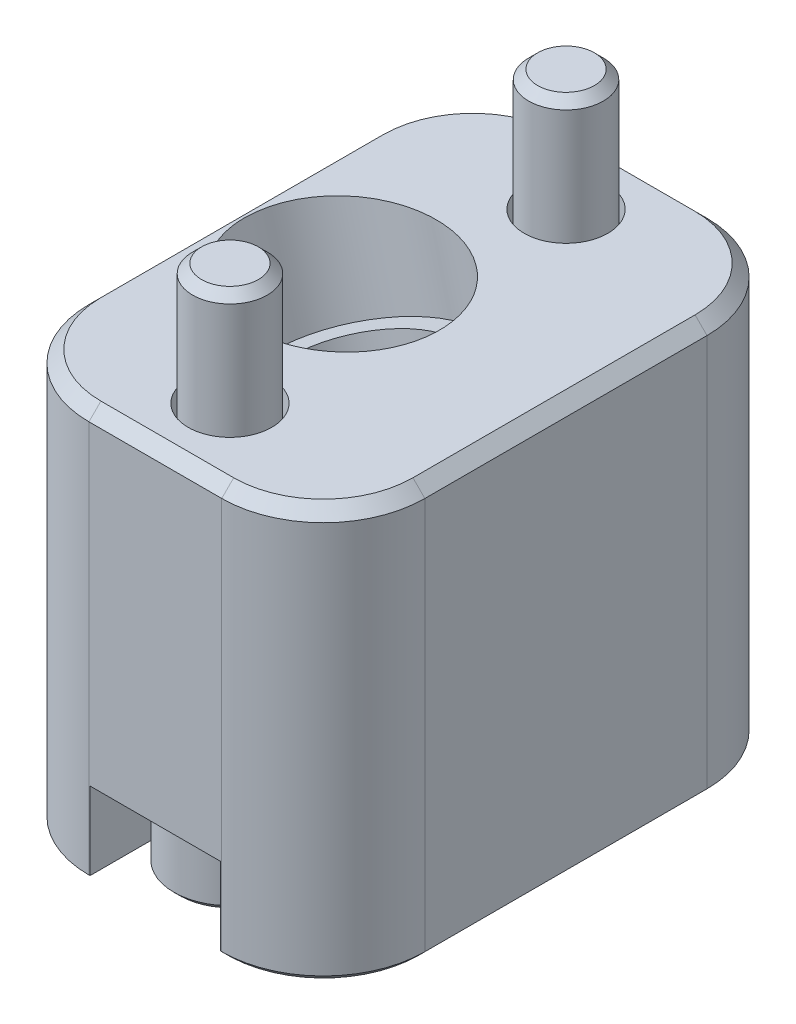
ISO-10303-21;
HEADER;
FILE_DESCRIPTION(('STEP AP214'),'2;1');
FILE_NAME('part.step','',(''),(''),'','','');
FILE_SCHEMA(('AUTOMOTIVE_DESIGN { 1 0 10303 214 1 1 1 1 }'));
ENDSEC;
DATA;
#1=APPLICATION_CONTEXT('core data for automotive mechanical design processes');
#2=APPLICATION_PROTOCOL_DEFINITION('international standard','automotive_design',2000,#1);
#3=PRODUCT_CONTEXT('',#1,'mechanical');
#4=PRODUCT('Part','Part','',(#3));
#5=PRODUCT_RELATED_PRODUCT_CATEGORY('part','',(#4));
#6=PRODUCT_DEFINITION_FORMATION('','',#4);
#7=PRODUCT_DEFINITION_CONTEXT('part definition',#1,'design');
#8=PRODUCT_DEFINITION('design','',#6,#7);
#9=PRODUCT_DEFINITION_SHAPE('','',#8);
#10=(LENGTH_UNIT() NAMED_UNIT(*) SI_UNIT(.MILLI.,.METRE.));
#11=(NAMED_UNIT(*) PLANE_ANGLE_UNIT() SI_UNIT($,.RADIAN.));
#12=(NAMED_UNIT(*) SI_UNIT($,.STERADIAN.) SOLID_ANGLE_UNIT());
#13=UNCERTAINTY_MEASURE_WITH_UNIT(LENGTH_MEASURE(1.E-05),#10,'distance_accuracy_value','');
#14=(GEOMETRIC_REPRESENTATION_CONTEXT(3) GLOBAL_UNCERTAINTY_ASSIGNED_CONTEXT((#13)) GLOBAL_UNIT_ASSIGNED_CONTEXT((#10,
#11,#12)) REPRESENTATION_CONTEXT('',''));
#15=CARTESIAN_POINT('',(0.,0.,0.));
#16=DIRECTION('',(0.,0.,1.));
#17=DIRECTION('',(1.,0.,0.));
#18=AXIS2_PLACEMENT_3D('',#15,#16,#17);
#19=CARTESIAN_POINT('',(4.75615,-34.1376,-19.05));
#20=DIRECTION('',(0.,-1.,0.));
#21=DIRECTION('',(-1.,0.,0.));
#22=AXIS2_PLACEMENT_3D('',#19,#20,#21);
#23=PLANE('',#22);
#24=CARTESIAN_POINT('',(4.75615,-34.1376,-14.2875));
#25=DIRECTION('',(0.,1.,0.));
#26=DIRECTION('',(-1.,0.,0.));
#27=AXIS2_PLACEMENT_3D('',#24,#25,#26);
#28=CIRCLE('',#27,4.2545);
#29=CARTESIAN_POINT('',(0.501650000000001,-34.1376,-14.2875));
#30=VERTEX_POINT('',#29);
#31=EDGE_CURVE('E12',#30,#30,#28,.T.);
#32=ORIENTED_EDGE('',*,*,#31,.F.);
#33=EDGE_LOOP('',(#32));
#34=FACE_BOUND('',#33,.T.);
#35=DIRECTION('',(0.866025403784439,0.,-0.5));
#36=VECTOR('',#35,1.);
#37=CARTESIAN_POINT('',(4.75615,-34.1376,-11.5305369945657));
#38=LINE('',#37,#36);
#39=CARTESIAN_POINT('',(4.75615,-34.1376,-11.5305369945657));
#40=VERTEX_POINT('',#39);
#41=CARTESIAN_POINT('',(7.14375,-34.1376,-12.9090184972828));
#42=VERTEX_POINT('',#41);
#43=EDGE_CURVE('E220',#40,#42,#38,.T.);
#44=ORIENTED_EDGE('',*,*,#43,.T.);
#45=DIRECTION('',(0.,0.,-1.));
#46=VECTOR('',#45,1.);
#47=CARTESIAN_POINT('',(7.14375,-34.1376,-12.9090184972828));
#48=LINE('',#47,#46);
#49=CARTESIAN_POINT('',(7.14375,-34.1376,-15.6659815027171));
#50=VERTEX_POINT('',#49);
#51=EDGE_CURVE('E222',#42,#50,#48,.T.);
#52=ORIENTED_EDGE('',*,*,#51,.T.);
#53=DIRECTION('',(-0.866025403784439,0.,-0.5));
#54=VECTOR('',#53,1.);
#55=CARTESIAN_POINT('',(7.14375,-34.1376,-15.6659815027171));
#56=LINE('',#55,#54);
#57=CARTESIAN_POINT('',(4.75615,-34.1376,-17.0444630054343));
#58=VERTEX_POINT('',#57);
#59=EDGE_CURVE('E224',#50,#58,#56,.T.);
#60=ORIENTED_EDGE('',*,*,#59,.T.);
#61=DIRECTION('',(-0.866025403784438,0.,0.5));
#62=VECTOR('',#61,1.);
#63=CARTESIAN_POINT('',(4.75615,-34.1376,-17.0444630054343));
#64=LINE('',#63,#62);
#65=CARTESIAN_POINT('',(2.36855,-34.1376,-15.6659815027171));
#66=VERTEX_POINT('',#65);
#67=EDGE_CURVE('E230',#58,#66,#64,.T.);
#68=ORIENTED_EDGE('',*,*,#67,.T.);
#69=DIRECTION('',(0.,0.,1.));
#70=VECTOR('',#69,1.);
#71=CARTESIAN_POINT('',(2.36855,-34.1376,-15.6659815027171));
#72=LINE('',#71,#70);
#73=CARTESIAN_POINT('',(2.36855,-34.1376,-12.9090184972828));
#74=VERTEX_POINT('',#73);
#75=EDGE_CURVE('E130',#66,#74,#72,.T.);
#76=ORIENTED_EDGE('',*,*,#75,.T.);
#77=DIRECTION('',(0.866025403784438,0.,0.5));
#78=VECTOR('',#77,1.);
#79=CARTESIAN_POINT('',(2.36855,-34.1376,-12.9090184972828));
#80=LINE('',#79,#78);
#81=EDGE_CURVE('E233',#74,#40,#80,.T.);
#82=ORIENTED_EDGE('',*,*,#81,.T.);
#83=EDGE_LOOP('',(#44,#52,#60,#68,#76,#82));
#84=FACE_BOUND('',#83,.T.);
#85=ADVANCED_FACE('F51',(#34,#84),#23,.T.);
#86=CARTESIAN_POINT('',(4.75615,10.3124,-14.2875));
#87=DIRECTION('',(0.,1.,0.));
#88=DIRECTION('',(1.,0.,0.));
#89=AXIS2_PLACEMENT_3D('',#86,#87,#88);
#90=CYLINDRICAL_SURFACE('',#89,4.7625);
#91=CARTESIAN_POINT('',(4.75615,-33.6296,-14.2875));
#92=DIRECTION('',(0.,1.,0.));
#93=DIRECTION('',(-1.,0.,0.));
#94=AXIS2_PLACEMENT_3D('',#91,#92,#93);
#95=CIRCLE('',#94,4.7625);
#96=CARTESIAN_POINT('',(-0.00634999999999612,-33.6296,-14.2875));
#97=VERTEX_POINT('',#96);
#98=EDGE_CURVE('E59',#97,#97,#95,.F.);
#99=ORIENTED_EDGE('',*,*,#98,.F.);
#100=EDGE_LOOP('',(#99));
#101=FACE_BOUND('',#100,.T.);
#102=CARTESIAN_POINT('',(4.75615,-27.7876,-14.2875));
#103=DIRECTION('',(0.,-1.,0.));
#104=DIRECTION('',(1.,0.,0.));
#105=AXIS2_PLACEMENT_3D('',#102,#103,#104);
#106=CIRCLE('',#105,4.7625);
#107=CARTESIAN_POINT('',(9.51865,-27.7876,-14.2875));
#108=VERTEX_POINT('',#107);
#109=EDGE_CURVE('E144',#108,#108,#106,.T.);
#110=ORIENTED_EDGE('',*,*,#109,.T.);
#111=EDGE_LOOP('',(#110));
#112=FACE_BOUND('',#111,.T.);
#113=ADVANCED_FACE('F156',(#101,#112),#90,.T.);
#114=CARTESIAN_POINT('',(4.75615,-27.7876,-17.4625));
#115=DIRECTION('',(0.,1.,0.));
#116=DIRECTION('',(1.,0.,0.));
#117=AXIS2_PLACEMENT_3D('',#114,#115,#116);
#118=PLANE('',#117);
#119=ORIENTED_EDGE('',*,*,#109,.F.);
#120=EDGE_LOOP('',(#119));
#121=FACE_BOUND('',#120,.T.);
#122=CARTESIAN_POINT('',(4.75615,-27.7876,-14.2875));
#123=DIRECTION('',(0.,-1.,0.));
#124=DIRECTION('',(1.,0.,0.));
#125=AXIS2_PLACEMENT_3D('',#122,#123,#124);
#126=CIRCLE('',#125,3.175);
#127=CARTESIAN_POINT('',(7.93115000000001,-27.7876,-14.2875));
#128=VERTEX_POINT('',#127);
#129=EDGE_CURVE('E141',#128,#128,#126,.T.);
#130=ORIENTED_EDGE('',*,*,#129,.T.);
#131=EDGE_LOOP('',(#130));
#132=FACE_BOUND('',#131,.T.);
#133=ADVANCED_FACE('F159',(#121,#132),#118,.T.);
#134=CARTESIAN_POINT('',(4.75615,10.3124,-14.2875));
#135=DIRECTION('',(0.,1.,0.));
#136=DIRECTION('',(1.,0.,0.));
#137=AXIS2_PLACEMENT_3D('',#134,#135,#136);
#138=CYLINDRICAL_SURFACE('',#137,3.175);
#139=CARTESIAN_POINT('',(4.75615,9.5504,-14.2875));
#140=DIRECTION('',(0.,-1.,0.));
#141=DIRECTION('',(1.,0.,0.));
#142=AXIS2_PLACEMENT_3D('',#139,#140,#141);
#143=CIRCLE('',#142,3.175);
#144=CARTESIAN_POINT('',(7.93115000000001,9.5504,-14.2875));
#145=VERTEX_POINT('',#144);
#146=EDGE_CURVE('E150',#145,#145,#143,.F.);
#147=ORIENTED_EDGE('',*,*,#146,.F.);
#148=EDGE_LOOP('',(#147));
#149=FACE_BOUND('',#148,.T.);
#150=ORIENTED_EDGE('',*,*,#129,.F.);
#151=EDGE_LOOP('',(#150));
#152=FACE_BOUND('',#151,.T.);
#153=ADVANCED_FACE('F165',(#149,#152),#138,.T.);
#154=CARTESIAN_POINT('',(4.75615,10.3124,-14.2875));
#155=DIRECTION('',(0.,1.,0.));
#156=DIRECTION('',(1.,0.,0.));
#157=AXIS2_PLACEMENT_3D('',#154,#155,#156);
#158=PLANE('',#157);
#159=CARTESIAN_POINT('',(4.75615,10.3124,-14.2875));
#160=DIRECTION('',(0.,-1.,0.));
#161=DIRECTION('',(1.,0.,0.));
#162=AXIS2_PLACEMENT_3D('',#159,#160,#161);
#163=CIRCLE('',#162,2.41299999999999);
#164=CARTESIAN_POINT('',(7.16915,10.3124,-14.2875));
#165=VERTEX_POINT('',#164);
#166=EDGE_CURVE('E147',#165,#165,#163,.T.);
#167=ORIENTED_EDGE('',*,*,#166,.F.);
#168=EDGE_LOOP('',(#167));
#169=FACE_BOUND('',#168,.T.);
#170=ADVANCED_FACE('F170',(#169),#158,.T.);
#171=CARTESIAN_POINT('',(4.75615,-30.5816,-11.5305369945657));
#172=DIRECTION('',(0.5,0.,0.866025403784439));
#173=DIRECTION('',(-0.866025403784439,0.,0.5));
#174=AXIS2_PLACEMENT_3D('',#171,#172,#173);
#175=PLANE('',#174);
#176=ORIENTED_EDGE('',*,*,#43,.F.);
#177=DIRECTION('',(0.,-1.,0.));
#178=VECTOR('',#177,1.);
#179=CARTESIAN_POINT('',(4.75615,-30.5816,-11.5305369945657));
#180=LINE('',#179,#178);
#181=CARTESIAN_POINT('',(4.75615,-30.5816,-11.5305369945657));
#182=VERTEX_POINT('',#181);
#183=EDGE_CURVE('E97',#182,#40,#180,.T.);
#184=ORIENTED_EDGE('',*,*,#183,.F.);
#185=DIRECTION('',(0.866025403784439,0.,-0.5));
#186=VECTOR('',#185,1.);
#187=CARTESIAN_POINT('',(4.75615,-30.5816,-11.5305369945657));
#188=LINE('',#187,#186);
#189=CARTESIAN_POINT('',(7.14375,-30.5816,-12.9090184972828));
#190=VERTEX_POINT('',#189);
#191=EDGE_CURVE('E234',#182,#190,#188,.T.);
#192=ORIENTED_EDGE('',*,*,#191,.T.);
#193=DIRECTION('',(0.,-1.,0.));
#194=VECTOR('',#193,1.);
#195=CARTESIAN_POINT('',(7.14375,-30.5816,-12.9090184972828));
#196=LINE('',#195,#194);
#197=EDGE_CURVE('E66',#190,#42,#196,.T.);
#198=ORIENTED_EDGE('',*,*,#197,.T.);
#199=EDGE_LOOP('',(#176,#184,#192,#198));
#200=FACE_BOUND('',#199,.T.);
#201=ADVANCED_FACE('F176',(#200),#175,.F.);
#202=CARTESIAN_POINT('',(2.36855,-30.5816,-12.9090184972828));
#203=DIRECTION('',(-0.5,0.,0.866025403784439));
#204=DIRECTION('',(-0.866025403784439,0.,-0.5));
#205=AXIS2_PLACEMENT_3D('',#202,#203,#204);
#206=PLANE('',#205);
#207=ORIENTED_EDGE('',*,*,#81,.F.);
#208=DIRECTION('',(0.,-1.,0.));
#209=VECTOR('',#208,1.);
#210=CARTESIAN_POINT('',(2.36855,-30.5816,-12.9090184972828));
#211=LINE('',#210,#209);
#212=CARTESIAN_POINT('',(2.36855,-30.5816,-12.9090184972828));
#213=VERTEX_POINT('',#212);
#214=EDGE_CURVE('E132',#213,#74,#211,.T.);
#215=ORIENTED_EDGE('',*,*,#214,.F.);
#216=DIRECTION('',(0.866025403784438,0.,0.5));
#217=VECTOR('',#216,1.);
#218=CARTESIAN_POINT('',(2.36855,-30.5816,-12.9090184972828));
#219=LINE('',#218,#217);
#220=EDGE_CURVE('E75',#213,#182,#219,.T.);
#221=ORIENTED_EDGE('',*,*,#220,.T.);
#222=ORIENTED_EDGE('',*,*,#183,.T.);
#223=EDGE_LOOP('',(#207,#215,#221,#222));
#224=FACE_BOUND('',#223,.T.);
#225=ADVANCED_FACE('F206',(#224),#206,.F.);
#226=CARTESIAN_POINT('',(2.36855,-30.5816,-15.6659815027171));
#227=DIRECTION('',(-1.,0.,0.));
#228=DIRECTION('',(0.,1.,0.));
#229=AXIS2_PLACEMENT_3D('',#226,#227,#228);
#230=PLANE('',#229);
#231=ORIENTED_EDGE('',*,*,#75,.F.);
#232=DIRECTION('',(0.,-1.,0.));
#233=VECTOR('',#232,1.);
#234=CARTESIAN_POINT('',(2.36855,-30.5816,-15.6659815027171));
#235=LINE('',#234,#233);
#236=CARTESIAN_POINT('',(2.36855,-30.5816,-15.6659815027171));
#237=VERTEX_POINT('',#236);
#238=EDGE_CURVE('E119',#237,#66,#235,.T.);
#239=ORIENTED_EDGE('',*,*,#238,.F.);
#240=DIRECTION('',(0.,0.,1.));
#241=VECTOR('',#240,1.);
#242=CARTESIAN_POINT('',(2.36855,-30.5816,-15.6659815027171));
#243=LINE('',#242,#241);
#244=EDGE_CURVE('E122',#237,#213,#243,.T.);
#245=ORIENTED_EDGE('',*,*,#244,.T.);
#246=ORIENTED_EDGE('',*,*,#214,.T.);
#247=EDGE_LOOP('',(#231,#239,#245,#246));
#248=FACE_BOUND('',#247,.T.);
#249=ADVANCED_FACE('F128',(#248),#230,.F.);
#250=CARTESIAN_POINT('',(4.75615,-30.5816,-17.0444630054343));
#251=DIRECTION('',(-0.5,0.,-0.866025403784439));
#252=DIRECTION('',(0.866025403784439,0.,-0.5));
#253=AXIS2_PLACEMENT_3D('',#250,#251,#252);
#254=PLANE('',#253);
#255=ORIENTED_EDGE('',*,*,#67,.F.);
#256=DIRECTION('',(0.,-1.,0.));
#257=VECTOR('',#256,1.);
#258=CARTESIAN_POINT('',(4.75615,-30.5816,-17.0444630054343));
#259=LINE('',#258,#257);
#260=CARTESIAN_POINT('',(4.75615,-30.5816,-17.0444630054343));
#261=VERTEX_POINT('',#260);
#262=EDGE_CURVE('E121',#261,#58,#259,.T.);
#263=ORIENTED_EDGE('',*,*,#262,.F.);
#264=DIRECTION('',(-0.866025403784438,0.,0.5));
#265=VECTOR('',#264,1.);
#266=CARTESIAN_POINT('',(4.75615,-30.5816,-17.0444630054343));
#267=LINE('',#266,#265);
#268=EDGE_CURVE('E114',#261,#237,#267,.T.);
#269=ORIENTED_EDGE('',*,*,#268,.T.);
#270=ORIENTED_EDGE('',*,*,#238,.T.);
#271=EDGE_LOOP('',(#255,#263,#269,#270));
#272=FACE_BOUND('',#271,.T.);
#273=ADVANCED_FACE('F117',(#272),#254,.F.);
#274=CARTESIAN_POINT('',(7.14375,-30.5816,-15.6659815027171));
#275=DIRECTION('',(0.5,0.,-0.866025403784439));
#276=DIRECTION('',(0.866025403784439,0.,0.5));
#277=AXIS2_PLACEMENT_3D('',#274,#275,#276);
#278=PLANE('',#277);
#279=ORIENTED_EDGE('',*,*,#59,.F.);
#280=DIRECTION('',(0.,-1.,0.));
#281=VECTOR('',#280,1.);
#282=CARTESIAN_POINT('',(7.14375,-30.5816,-15.6659815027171));
#283=LINE('',#282,#281);
#284=CARTESIAN_POINT('',(7.14375,-30.5816,-15.6659815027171));
#285=VERTEX_POINT('',#284);
#286=EDGE_CURVE('E135',#285,#50,#283,.T.);
#287=ORIENTED_EDGE('',*,*,#286,.F.);
#288=DIRECTION('',(-0.866025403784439,0.,-0.5));
#289=VECTOR('',#288,1.);
#290=CARTESIAN_POINT('',(7.14375,-30.5816,-15.6659815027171));
#291=LINE('',#290,#289);
#292=EDGE_CURVE('E123',#285,#261,#291,.T.);
#293=ORIENTED_EDGE('',*,*,#292,.T.);
#294=ORIENTED_EDGE('',*,*,#262,.T.);
#295=EDGE_LOOP('',(#279,#287,#293,#294));
#296=FACE_BOUND('',#295,.T.);
#297=ADVANCED_FACE('F202',(#296),#278,.F.);
#298=CARTESIAN_POINT('',(7.14375,-30.5816,-12.9090184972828));
#299=DIRECTION('',(1.,0.,0.));
#300=DIRECTION('',(0.,-1.,0.));
#301=AXIS2_PLACEMENT_3D('',#298,#299,#300);
#302=PLANE('',#301);
#303=ORIENTED_EDGE('',*,*,#51,.F.);
#304=ORIENTED_EDGE('',*,*,#197,.F.);
#305=DIRECTION('',(0.,0.,-1.));
#306=VECTOR('',#305,1.);
#307=CARTESIAN_POINT('',(7.14375,-30.5816,-12.9090184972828));
#308=LINE('',#307,#306);
#309=EDGE_CURVE('E105',#190,#285,#308,.T.);
#310=ORIENTED_EDGE('',*,*,#309,.T.);
#311=ORIENTED_EDGE('',*,*,#286,.T.);
#312=EDGE_LOOP('',(#303,#304,#310,#311));
#313=FACE_BOUND('',#312,.T.);
#314=ADVANCED_FACE('F195',(#313),#302,.F.);
#315=CARTESIAN_POINT('',(4.75615,-30.5816,-11.5305369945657));
#316=DIRECTION('',(0.,1.,0.));
#317=DIRECTION('',(1.,0.,0.));
#318=AXIS2_PLACEMENT_3D('',#315,#316,#317);
#319=PLANE('',#318);
#320=ORIENTED_EDGE('',*,*,#191,.F.);
#321=ORIENTED_EDGE('',*,*,#220,.F.);
#322=ORIENTED_EDGE('',*,*,#244,.F.);
#323=ORIENTED_EDGE('',*,*,#268,.F.);
#324=ORIENTED_EDGE('',*,*,#292,.F.);
#325=ORIENTED_EDGE('',*,*,#309,.F.);
#326=EDGE_LOOP('',(#320,#321,#322,#323,#324,#325));
#327=FACE_BOUND('',#326,.T.);
#328=ADVANCED_FACE('F125',(#327),#319,.F.);
#329=CARTESIAN_POINT('',(4.75615,10.3124,-14.2875));
#330=DIRECTION('',(0.,-1.,0.));
#331=DIRECTION('',(-1.,0.,0.));
#332=AXIS2_PLACEMENT_3D('',#329,#330,#331);
#333=CONICAL_SURFACE('',#332,2.41299999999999,0.78539816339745);
#334=ORIENTED_EDGE('',*,*,#146,.T.);
#335=EDGE_LOOP('',(#334));
#336=FACE_BOUND('',#335,.T.);
#337=ORIENTED_EDGE('',*,*,#166,.T.);
#338=EDGE_LOOP('',(#337));
#339=FACE_BOUND('',#338,.T.);
#340=ADVANCED_FACE('F187',(#336,#339),#333,.T.);
#341=CARTESIAN_POINT('',(4.75615,-33.6296,-14.2875));
#342=DIRECTION('',(0.,1.,0.));
#343=DIRECTION('',(1.,0.,0.));
#344=AXIS2_PLACEMENT_3D('',#341,#342,#343);
#345=CONICAL_SURFACE('',#344,4.7625,0.785398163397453);
#346=ORIENTED_EDGE('',*,*,#31,.T.);
#347=EDGE_LOOP('',(#346));
#348=FACE_BOUND('',#347,.T.);
#349=ORIENTED_EDGE('',*,*,#98,.T.);
#350=EDGE_LOOP('',(#349));
#351=FACE_BOUND('',#350,.T.);
#352=ADVANCED_FACE('F53',(#348,#351),#345,.T.);
#353=CLOSED_SHELL('',(#85,#113,#133,#153,#170,#201,#225,#249,#273,#297,#314,#328,#340,#352));
#354=MANIFOLD_SOLID_BREP('B2',#353);
#355=CARTESIAN_POINT('',(4.75615,-34.1376,19.05));
#356=DIRECTION('',(0.,-1.,0.));
#357=DIRECTION('',(-1.,0.,0.));
#358=AXIS2_PLACEMENT_3D('',#355,#356,#357);
#359=PLANE('',#358);
#360=CARTESIAN_POINT('',(4.75615,-34.1376,14.2875));
#361=DIRECTION('',(0.,-1.,0.));
#362=DIRECTION('',(-1.,0.,0.));
#363=AXIS2_PLACEMENT_3D('',#360,#361,#362);
#364=CIRCLE('',#363,4.2545);
#365=CARTESIAN_POINT('',(0.501650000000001,-34.1376,14.2875));
#366=VERTEX_POINT('',#365);
#367=EDGE_CURVE('E49',#366,#366,#364,.T.);
#368=ORIENTED_EDGE('',*,*,#367,.T.);
#369=EDGE_LOOP('',(#368));
#370=FACE_BOUND('',#369,.T.);
#371=DIRECTION('',(0.866025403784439,0.,0.5));
#372=VECTOR('',#371,1.);
#373=CARTESIAN_POINT('',(4.75615,-34.1376,11.5305369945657));
#374=LINE('',#373,#372);
#375=CARTESIAN_POINT('',(4.75615,-34.1376,11.5305369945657));
#376=VERTEX_POINT('',#375);
#377=CARTESIAN_POINT('',(7.14375,-34.1376,12.9090184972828));
#378=VERTEX_POINT('',#377);
#379=EDGE_CURVE('E341',#376,#378,#374,.T.);
#380=ORIENTED_EDGE('',*,*,#379,.F.);
#381=DIRECTION('',(0.866025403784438,0.,-0.5));
#382=VECTOR('',#381,1.);
#383=CARTESIAN_POINT('',(2.36855,-34.1376,12.9090184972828));
#384=LINE('',#383,#382);
#385=CARTESIAN_POINT('',(2.36855,-34.1376,12.9090184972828));
#386=VERTEX_POINT('',#385);
#387=EDGE_CURVE('E424',#386,#376,#384,.T.);
#388=ORIENTED_EDGE('',*,*,#387,.F.);
#389=DIRECTION('',(0.,0.,-1.));
#390=VECTOR('',#389,1.);
#391=CARTESIAN_POINT('',(2.36855,-34.1376,15.6659815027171));
#392=LINE('',#391,#390);
#393=CARTESIAN_POINT('',(2.36855,-34.1376,15.6659815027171));
#394=VERTEX_POINT('',#393);
#395=EDGE_CURVE('E422',#394,#386,#392,.T.);
#396=ORIENTED_EDGE('',*,*,#395,.F.);
#397=DIRECTION('',(-0.866025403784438,0.,-0.5));
#398=VECTOR('',#397,1.);
#399=CARTESIAN_POINT('',(4.75615,-34.1376,17.0444630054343));
#400=LINE('',#399,#398);
#401=CARTESIAN_POINT('',(4.75615,-34.1376,17.0444630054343));
#402=VERTEX_POINT('',#401);
#403=EDGE_CURVE('E389',#402,#394,#400,.T.);
#404=ORIENTED_EDGE('',*,*,#403,.F.);
#405=DIRECTION('',(-0.866025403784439,0.,0.5));
#406=VECTOR('',#405,1.);
#407=CARTESIAN_POINT('',(7.14375,-34.1376,15.6659815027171));
#408=LINE('',#407,#406);
#409=CARTESIAN_POINT('',(7.14375,-34.1376,15.6659815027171));
#410=VERTEX_POINT('',#409);
#411=EDGE_CURVE('E418',#410,#402,#408,.T.);
#412=ORIENTED_EDGE('',*,*,#411,.F.);
#413=DIRECTION('',(0.,0.,1.));
#414=VECTOR('',#413,1.);
#415=CARTESIAN_POINT('',(7.14375,-34.1376,12.9090184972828));
#416=LINE('',#415,#414);
#417=EDGE_CURVE('E415',#378,#410,#416,.T.);
#418=ORIENTED_EDGE('',*,*,#417,.F.);
#419=EDGE_LOOP('',(#380,#388,#396,#404,#412,#418));
#420=FACE_BOUND('',#419,.T.);
#421=ADVANCED_FACE('F326',(#370,#420),#359,.T.);
#422=CARTESIAN_POINT('',(4.75615,10.3124,14.2875));
#423=DIRECTION('',(0.,1.,0.));
#424=DIRECTION('',(1.,0.,0.));
#425=AXIS2_PLACEMENT_3D('',#422,#423,#424);
#426=CYLINDRICAL_SURFACE('',#425,4.7625);
#427=CARTESIAN_POINT('',(4.75615,-33.6296,14.2875));
#428=DIRECTION('',(0.,-1.,0.));
#429=DIRECTION('',(-1.,0.,0.));
#430=AXIS2_PLACEMENT_3D('',#427,#428,#429);
#431=CIRCLE('',#430,4.7625);
#432=CARTESIAN_POINT('',(-0.00634999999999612,-33.6296,14.2875));
#433=VERTEX_POINT('',#432);
#434=EDGE_CURVE('E334',#433,#433,#431,.F.);
#435=ORIENTED_EDGE('',*,*,#434,.T.);
#436=EDGE_LOOP('',(#435));
#437=FACE_BOUND('',#436,.T.);
#438=CARTESIAN_POINT('',(4.75615,-27.7876,14.2875));
#439=DIRECTION('',(0.,1.,0.));
#440=DIRECTION('',(1.,0.,0.));
#441=AXIS2_PLACEMENT_3D('',#438,#439,#440);
#442=CIRCLE('',#441,4.7625);
#443=CARTESIAN_POINT('',(9.51865,-27.7876,14.2875));
#444=VERTEX_POINT('',#443);
#445=EDGE_CURVE('E436',#444,#444,#442,.T.);
#446=ORIENTED_EDGE('',*,*,#445,.F.);
#447=EDGE_LOOP('',(#446));
#448=FACE_BOUND('',#447,.T.);
#449=ADVANCED_FACE('F447',(#437,#448),#426,.T.);
#450=CARTESIAN_POINT('',(4.75615,-27.7876,17.4625));
#451=DIRECTION('',(0.,1.,0.));
#452=DIRECTION('',(1.,0.,0.));
#453=AXIS2_PLACEMENT_3D('',#450,#451,#452);
#454=PLANE('',#453);
#455=ORIENTED_EDGE('',*,*,#445,.T.);
#456=EDGE_LOOP('',(#455));
#457=FACE_BOUND('',#456,.T.);
#458=CARTESIAN_POINT('',(4.75615,-27.7876,14.2875));
#459=DIRECTION('',(0.,1.,0.));
#460=DIRECTION('',(1.,0.,0.));
#461=AXIS2_PLACEMENT_3D('',#458,#459,#460);
#462=CIRCLE('',#461,3.175);
#463=CARTESIAN_POINT('',(7.93115000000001,-27.7876,14.2875));
#464=VERTEX_POINT('',#463);
#465=EDGE_CURVE('E428',#464,#464,#462,.T.);
#466=ORIENTED_EDGE('',*,*,#465,.F.);
#467=EDGE_LOOP('',(#466));
#468=FACE_BOUND('',#467,.T.);
#469=ADVANCED_FACE('F464',(#457,#468),#454,.T.);
#470=CARTESIAN_POINT('',(4.75615,10.3124,14.2875));
#471=DIRECTION('',(0.,1.,0.));
#472=DIRECTION('',(1.,0.,0.));
#473=AXIS2_PLACEMENT_3D('',#470,#471,#472);
#474=CYLINDRICAL_SURFACE('',#473,3.175);
#475=CARTESIAN_POINT('',(4.75615,9.5504,14.2875));
#476=DIRECTION('',(0.,1.,0.));
#477=DIRECTION('',(1.,0.,0.));
#478=AXIS2_PLACEMENT_3D('',#475,#476,#477);
#479=CIRCLE('',#478,3.175);
#480=CARTESIAN_POINT('',(7.93115000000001,9.5504,14.2875));
#481=VERTEX_POINT('',#480);
#482=EDGE_CURVE('E442',#481,#481,#479,.F.);
#483=ORIENTED_EDGE('',*,*,#482,.T.);
#484=EDGE_LOOP('',(#483));
#485=FACE_BOUND('',#484,.T.);
#486=ORIENTED_EDGE('',*,*,#465,.T.);
#487=EDGE_LOOP('',(#486));
#488=FACE_BOUND('',#487,.T.);
#489=ADVANCED_FACE('F470',(#485,#488),#474,.T.);
#490=CARTESIAN_POINT('',(4.75615,10.3124,14.2875));
#491=DIRECTION('',(0.,1.,0.));
#492=DIRECTION('',(1.,0.,0.));
#493=AXIS2_PLACEMENT_3D('',#490,#491,#492);
#494=PLANE('',#493);
#495=CARTESIAN_POINT('',(4.75615,10.3124,14.2875));
#496=DIRECTION('',(0.,1.,0.));
#497=DIRECTION('',(1.,0.,0.));
#498=AXIS2_PLACEMENT_3D('',#495,#496,#497);
#499=CIRCLE('',#498,2.41299999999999);
#500=CARTESIAN_POINT('',(7.16915,10.3124,14.2875));
#501=VERTEX_POINT('',#500);
#502=EDGE_CURVE('E439',#501,#501,#499,.T.);
#503=ORIENTED_EDGE('',*,*,#502,.T.);
#504=EDGE_LOOP('',(#503));
#505=FACE_BOUND('',#504,.T.);
#506=ADVANCED_FACE('F474',(#505),#494,.T.);
#507=CARTESIAN_POINT('',(4.75615,-30.5816,11.5305369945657));
#508=DIRECTION('',(0.5,0.,-0.866025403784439));
#509=DIRECTION('',(-0.866025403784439,0.,-0.5));
#510=AXIS2_PLACEMENT_3D('',#507,#508,#509);
#511=PLANE('',#510);
#512=ORIENTED_EDGE('',*,*,#379,.T.);
#513=DIRECTION('',(0.,-1.,0.));
#514=VECTOR('',#513,1.);
#515=CARTESIAN_POINT('',(7.14375,-30.5816,12.9090184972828));
#516=LINE('',#515,#514);
#517=CARTESIAN_POINT('',(7.14375,-30.5816,12.9090184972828));
#518=VERTEX_POINT('',#517);
#519=EDGE_CURVE('E371',#518,#378,#516,.T.);
#520=ORIENTED_EDGE('',*,*,#519,.F.);
#521=DIRECTION('',(0.866025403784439,0.,0.5));
#522=VECTOR('',#521,1.);
#523=CARTESIAN_POINT('',(4.75615,-30.5816,11.5305369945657));
#524=LINE('',#523,#522);
#525=CARTESIAN_POINT('',(4.75615,-30.5816,11.5305369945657));
#526=VERTEX_POINT('',#525);
#527=EDGE_CURVE('E426',#526,#518,#524,.T.);
#528=ORIENTED_EDGE('',*,*,#527,.F.);
#529=DIRECTION('',(0.,-1.,0.));
#530=VECTOR('',#529,1.);
#531=CARTESIAN_POINT('',(4.75615,-30.5816,11.5305369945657));
#532=LINE('',#531,#530);
#533=EDGE_CURVE('E349',#526,#376,#532,.T.);
#534=ORIENTED_EDGE('',*,*,#533,.T.);
#535=EDGE_LOOP('',(#512,#520,#528,#534));
#536=FACE_BOUND('',#535,.T.);
#537=ADVANCED_FACE('F478',(#536),#511,.F.);
#538=CARTESIAN_POINT('',(2.36855,-30.5816,12.9090184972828));
#539=DIRECTION('',(-0.5,0.,-0.866025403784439));
#540=DIRECTION('',(-0.866025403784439,0.,0.5));
#541=AXIS2_PLACEMENT_3D('',#538,#539,#540);
#542=PLANE('',#541);
#543=ORIENTED_EDGE('',*,*,#387,.T.);
#544=ORIENTED_EDGE('',*,*,#533,.F.);
#545=DIRECTION('',(0.866025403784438,0.,-0.5));
#546=VECTOR('',#545,1.);
#547=CARTESIAN_POINT('',(2.36855,-30.5816,12.9090184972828));
#548=LINE('',#547,#546);
#549=CARTESIAN_POINT('',(2.36855,-30.5816,12.9090184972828));
#550=VERTEX_POINT('',#549);
#551=EDGE_CURVE('E401',#550,#526,#548,.T.);
#552=ORIENTED_EDGE('',*,*,#551,.F.);
#553=DIRECTION('',(0.,-1.,0.));
#554=VECTOR('',#553,1.);
#555=CARTESIAN_POINT('',(2.36855,-30.5816,12.9090184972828));
#556=LINE('',#555,#554);
#557=EDGE_CURVE('E393',#550,#386,#556,.T.);
#558=ORIENTED_EDGE('',*,*,#557,.T.);
#559=EDGE_LOOP('',(#543,#544,#552,#558));
#560=FACE_BOUND('',#559,.T.);
#561=ADVANCED_FACE('F482',(#560),#542,.F.);
#562=CARTESIAN_POINT('',(2.36855,-30.5816,15.6659815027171));
#563=DIRECTION('',(-1.,0.,0.));
#564=DIRECTION('',(0.,1.,0.));
#565=AXIS2_PLACEMENT_3D('',#562,#563,#564);
#566=PLANE('',#565);
#567=ORIENTED_EDGE('',*,*,#395,.T.);
#568=ORIENTED_EDGE('',*,*,#557,.F.);
#569=DIRECTION('',(0.,0.,-1.));
#570=VECTOR('',#569,1.);
#571=CARTESIAN_POINT('',(2.36855,-30.5816,15.6659815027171));
#572=LINE('',#571,#570);
#573=CARTESIAN_POINT('',(2.36855,-30.5816,15.6659815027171));
#574=VERTEX_POINT('',#573);
#575=EDGE_CURVE('E397',#574,#550,#572,.T.);
#576=ORIENTED_EDGE('',*,*,#575,.F.);
#577=DIRECTION('',(0.,-1.,0.));
#578=VECTOR('',#577,1.);
#579=CARTESIAN_POINT('',(2.36855,-30.5816,15.6659815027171));
#580=LINE('',#579,#578);
#581=EDGE_CURVE('E382',#574,#394,#580,.T.);
#582=ORIENTED_EDGE('',*,*,#581,.T.);
#583=EDGE_LOOP('',(#567,#568,#576,#582));
#584=FACE_BOUND('',#583,.T.);
#585=ADVANCED_FACE('F398',(#584),#566,.F.);
#586=CARTESIAN_POINT('',(4.75615,-30.5816,17.0444630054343));
#587=DIRECTION('',(-0.5,0.,0.866025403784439));
#588=DIRECTION('',(0.866025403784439,0.,0.5));
#589=AXIS2_PLACEMENT_3D('',#586,#587,#588);
#590=PLANE('',#589);
#591=ORIENTED_EDGE('',*,*,#403,.T.);
#592=ORIENTED_EDGE('',*,*,#581,.F.);
#593=DIRECTION('',(-0.866025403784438,0.,-0.5));
#594=VECTOR('',#593,1.);
#595=CARTESIAN_POINT('',(4.75615,-30.5816,17.0444630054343));
#596=LINE('',#595,#594);
#597=CARTESIAN_POINT('',(4.75615,-30.5816,17.0444630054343));
#598=VERTEX_POINT('',#597);
#599=EDGE_CURVE('E386',#598,#574,#596,.T.);
#600=ORIENTED_EDGE('',*,*,#599,.F.);
#601=DIRECTION('',(0.,-1.,0.));
#602=VECTOR('',#601,1.);
#603=CARTESIAN_POINT('',(4.75615,-30.5816,17.0444630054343));
#604=LINE('',#603,#602);
#605=EDGE_CURVE('E394',#598,#402,#604,.T.);
#606=ORIENTED_EDGE('',*,*,#605,.T.);
#607=EDGE_LOOP('',(#591,#592,#600,#606));
#608=FACE_BOUND('',#607,.T.);
#609=ADVANCED_FACE('F384',(#608),#590,.F.);
#610=CARTESIAN_POINT('',(7.14375,-30.5816,15.6659815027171));
#611=DIRECTION('',(0.5,0.,0.866025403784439));
#612=DIRECTION('',(0.866025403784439,0.,-0.5));
#613=AXIS2_PLACEMENT_3D('',#610,#611,#612);
#614=PLANE('',#613);
#615=ORIENTED_EDGE('',*,*,#411,.T.);
#616=ORIENTED_EDGE('',*,*,#605,.F.);
#617=DIRECTION('',(-0.866025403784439,0.,0.5));
#618=VECTOR('',#617,1.);
#619=CARTESIAN_POINT('',(7.14375,-30.5816,15.6659815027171));
#620=LINE('',#619,#618);
#621=CARTESIAN_POINT('',(7.14375,-30.5816,15.6659815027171));
#622=VERTEX_POINT('',#621);
#623=EDGE_CURVE('E407',#622,#598,#620,.T.);
#624=ORIENTED_EDGE('',*,*,#623,.F.);
#625=DIRECTION('',(0.,-1.,0.));
#626=VECTOR('',#625,1.);
#627=CARTESIAN_POINT('',(7.14375,-30.5816,15.6659815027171));
#628=LINE('',#627,#626);
#629=EDGE_CURVE('E431',#622,#410,#628,.T.);
#630=ORIENTED_EDGE('',*,*,#629,.T.);
#631=EDGE_LOOP('',(#615,#616,#624,#630));
#632=FACE_BOUND('',#631,.T.);
#633=ADVANCED_FACE('F486',(#632),#614,.F.);
#634=CARTESIAN_POINT('',(7.14375,-30.5816,12.9090184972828));
#635=DIRECTION('',(1.,0.,0.));
#636=DIRECTION('',(0.,-1.,0.));
#637=AXIS2_PLACEMENT_3D('',#634,#635,#636);
#638=PLANE('',#637);
#639=ORIENTED_EDGE('',*,*,#417,.T.);
#640=ORIENTED_EDGE('',*,*,#629,.F.);
#641=DIRECTION('',(0.,0.,1.));
#642=VECTOR('',#641,1.);
#643=CARTESIAN_POINT('',(7.14375,-30.5816,12.9090184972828));
#644=LINE('',#643,#642);
#645=EDGE_CURVE('E409',#518,#622,#644,.T.);
#646=ORIENTED_EDGE('',*,*,#645,.F.);
#647=ORIENTED_EDGE('',*,*,#519,.T.);
#648=EDGE_LOOP('',(#639,#640,#646,#647));
#649=FACE_BOUND('',#648,.T.);
#650=ADVANCED_FACE('F483',(#649),#638,.F.);
#651=CARTESIAN_POINT('',(4.75615,-30.5816,11.5305369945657));
#652=DIRECTION('',(0.,1.,0.));
#653=DIRECTION('',(1.,0.,0.));
#654=AXIS2_PLACEMENT_3D('',#651,#652,#653);
#655=PLANE('',#654);
#656=ORIENTED_EDGE('',*,*,#527,.T.);
#657=ORIENTED_EDGE('',*,*,#645,.T.);
#658=ORIENTED_EDGE('',*,*,#623,.T.);
#659=ORIENTED_EDGE('',*,*,#599,.T.);
#660=ORIENTED_EDGE('',*,*,#575,.T.);
#661=ORIENTED_EDGE('',*,*,#551,.T.);
#662=EDGE_LOOP('',(#656,#657,#658,#659,#660,#661));
#663=FACE_BOUND('',#662,.T.);
#664=ADVANCED_FACE('F404',(#663),#655,.F.);
#665=CARTESIAN_POINT('',(4.75615,10.3124,14.2875));
#666=DIRECTION('',(0.,-1.,0.));
#667=DIRECTION('',(-1.,0.,0.));
#668=AXIS2_PLACEMENT_3D('',#665,#666,#667);
#669=CONICAL_SURFACE('',#668,2.41299999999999,0.78539816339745);
#670=ORIENTED_EDGE('',*,*,#482,.F.);
#671=EDGE_LOOP('',(#670));
#672=FACE_BOUND('',#671,.T.);
#673=ORIENTED_EDGE('',*,*,#502,.F.);
#674=EDGE_LOOP('',(#673));
#675=FACE_BOUND('',#674,.T.);
#676=ADVANCED_FACE('F451',(#672,#675),#669,.T.);
#677=CARTESIAN_POINT('',(4.75615,-33.6296,14.2875));
#678=DIRECTION('',(0.,1.,0.));
#679=DIRECTION('',(1.,0.,0.));
#680=AXIS2_PLACEMENT_3D('',#677,#678,#679);
#681=CONICAL_SURFACE('',#680,4.7625,0.785398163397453);
#682=ORIENTED_EDGE('',*,*,#367,.F.);
#683=EDGE_LOOP('',(#682));
#684=FACE_BOUND('',#683,.T.);
#685=ORIENTED_EDGE('',*,*,#434,.F.);
#686=EDGE_LOOP('',(#685));
#687=FACE_BOUND('',#686,.T.);
#688=ADVANCED_FACE('F328',(#684,#687),#681,.T.);
#689=CLOSED_SHELL('',(#421,#449,#469,#489,#506,#537,#561,#585,#609,#633,#650,#664,#676,#688));
#690=MANIFOLD_SOLID_BREP('B6',#689);
#691=CARTESIAN_POINT('',(10.4013,0.,-11.99515));
#692=DIRECTION('',(0.,-1.,0.));
#693=DIRECTION('',(0.,0.,-1.));
#694=AXIS2_PLACEMENT_3D('',#691,#692,#693);
#695=CYLINDRICAL_SURFACE('',#694,8.636);
#696=DIRECTION('',(0.,-1.,0.));
#697=VECTOR('',#696,1.);
#698=CARTESIAN_POINT('',(19.0373,0.,-11.99515));
#699=LINE('',#698,#697);
#700=CARTESIAN_POINT('',(19.0373,-1.016,-11.99515));
#701=VERTEX_POINT('',#700);
#702=CARTESIAN_POINT('',(19.0373,-34.3916,-11.99515));
#703=VERTEX_POINT('',#702);
#704=EDGE_CURVE('E870',#701,#703,#699,.T.);
#705=ORIENTED_EDGE('',*,*,#704,.T.);
#706=CARTESIAN_POINT('',(10.4013,-34.3916,-11.99515));
#707=DIRECTION('',(0.,-1.,0.));
#708=DIRECTION('',(0.,0.,-1.));
#709=AXIS2_PLACEMENT_3D('',#706,#707,#708);
#710=CIRCLE('',#709,8.636);
#711=CARTESIAN_POINT('',(10.4013,-34.3916,-20.63115));
#712=VERTEX_POINT('',#711);
#713=EDGE_CURVE('E987',#703,#712,#710,.F.);
#714=ORIENTED_EDGE('',*,*,#713,.T.);
#715=DIRECTION('',(0.,-1.,0.));
#716=VECTOR('',#715,1.);
#717=CARTESIAN_POINT('',(10.4013,0.,-20.63115));
#718=LINE('',#717,#716);
#719=CARTESIAN_POINT('',(10.4013,-1.016,-20.63115));
#720=VERTEX_POINT('',#719);
#721=EDGE_CURVE('E891',#720,#712,#718,.T.);
#722=ORIENTED_EDGE('',*,*,#721,.F.);
#723=CARTESIAN_POINT('',(10.4013,-1.016,-11.99515));
#724=DIRECTION('',(0.,-1.,0.));
#725=DIRECTION('',(0.,0.,-1.));
#726=AXIS2_PLACEMENT_3D('',#723,#724,#725);
#727=CIRCLE('',#726,8.636);
#728=EDGE_CURVE('E920',#720,#701,#727,.T.);
#729=ORIENTED_EDGE('',*,*,#728,.T.);
#730=EDGE_LOOP('',(#705,#714,#722,#729));
#731=FACE_BOUND('',#730,.T.);
#732=ADVANCED_FACE('F592',(#731),#695,.T.);
#733=CARTESIAN_POINT('',(10.4013,0.,-20.63115));
#734=DIRECTION('',(0.,0.,1.));
#735=DIRECTION('',(1.,0.,0.));
#736=AXIS2_PLACEMENT_3D('',#733,#734,#735);
#737=PLANE('',#736);
#738=DIRECTION('',(0.,-1.,0.));
#739=VECTOR('',#738,1.);
#740=CARTESIAN_POINT('',(-0.800099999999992,-11.5058532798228,-20.63115));
#741=LINE('',#740,#739);
#742=CARTESIAN_POINT('',(-0.800099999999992,-27.7876,-20.63115));
#743=VERTEX_POINT('',#742);
#744=CARTESIAN_POINT('',(-0.800099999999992,-34.3916,-20.63115));
#745=VERTEX_POINT('',#744);
#746=EDGE_CURVE('E820',#743,#745,#741,.T.);
#747=ORIENTED_EDGE('',*,*,#746,.T.);
#748=DIRECTION('',(-1.,0.,0.));
#749=VECTOR('',#748,1.);
#750=CARTESIAN_POINT('',(-0.889000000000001,-34.3916,-20.63115));
#751=LINE('',#750,#749);
#752=CARTESIAN_POINT('',(-0.889000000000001,-34.3916,-20.63115));
#753=VERTEX_POINT('',#752);
#754=EDGE_CURVE('E959',#745,#753,#751,.T.);
#755=ORIENTED_EDGE('',*,*,#754,.T.);
#756=DIRECTION('',(0.,-1.,0.));
#757=VECTOR('',#756,1.);
#758=CARTESIAN_POINT('',(-0.889000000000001,0.,-20.63115));
#759=LINE('',#758,#757);
#760=CARTESIAN_POINT('',(-0.889000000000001,-1.016,-20.63115));
#761=VERTEX_POINT('',#760);
#762=EDGE_CURVE('E888',#761,#753,#759,.T.);
#763=ORIENTED_EDGE('',*,*,#762,.F.);
#764=DIRECTION('',(1.,0.,0.));
#765=VECTOR('',#764,1.);
#766=CARTESIAN_POINT('',(10.4013,-1.016,-20.63115));
#767=LINE('',#766,#765);
#768=EDGE_CURVE('E915',#761,#720,#767,.T.);
#769=ORIENTED_EDGE('',*,*,#768,.T.);
#770=ORIENTED_EDGE('',*,*,#721,.T.);
#771=DIRECTION('',(-1.,0.,0.));
#772=VECTOR('',#771,1.);
#773=CARTESIAN_POINT('',(10.3124,-34.3916,-20.63115));
#774=LINE('',#773,#772);
#775=CARTESIAN_POINT('',(10.3124,-34.3916,-20.63115));
#776=VERTEX_POINT('',#775);
#777=EDGE_CURVE('E932',#712,#776,#774,.T.);
#778=ORIENTED_EDGE('',*,*,#777,.T.);
#779=DIRECTION('',(0.,-1.,0.));
#780=VECTOR('',#779,1.);
#781=CARTESIAN_POINT('',(10.3124,-11.5058532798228,-20.63115));
#782=LINE('',#781,#780);
#783=CARTESIAN_POINT('',(10.3124,-27.7876,-20.63115));
#784=VERTEX_POINT('',#783);
#785=EDGE_CURVE('E826',#784,#776,#782,.T.);
#786=ORIENTED_EDGE('',*,*,#785,.F.);
#787=DIRECTION('',(1.,0.,0.));
#788=VECTOR('',#787,1.);
#789=CARTESIAN_POINT('',(10.3124,-27.7876,-20.63115));
#790=LINE('',#789,#788);
#791=EDGE_CURVE('E827',#743,#784,#790,.T.);
#792=ORIENTED_EDGE('',*,*,#791,.F.);
#793=EDGE_LOOP('',(#747,#755,#763,#769,#770,#778,#786,#792));
#794=FACE_BOUND('',#793,.T.);
#795=ADVANCED_FACE('F1228',(#794),#737,.F.);
#796=CARTESIAN_POINT('',(-0.889,0.,-11.99515));
#797=DIRECTION('',(0.,-1.,0.));
#798=DIRECTION('',(0.,0.,-1.));
#799=AXIS2_PLACEMENT_3D('',#796,#797,#798);
#800=CYLINDRICAL_SURFACE('',#799,8.636);
#801=ORIENTED_EDGE('',*,*,#762,.T.);
#802=CARTESIAN_POINT('',(-0.889,-34.3916,-11.99515));
#803=DIRECTION('',(0.,-1.,0.));
#804=DIRECTION('',(0.,0.,-1.));
#805=AXIS2_PLACEMENT_3D('',#802,#803,#804);
#806=CIRCLE('',#805,8.636);
#807=CARTESIAN_POINT('',(-9.525,-34.3916,-11.99515));
#808=VERTEX_POINT('',#807);
#809=EDGE_CURVE('E976',#753,#808,#806,.F.);
#810=ORIENTED_EDGE('',*,*,#809,.T.);
#811=DIRECTION('',(0.,-1.,0.));
#812=VECTOR('',#811,1.);
#813=CARTESIAN_POINT('',(-9.525,0.,-11.99515));
#814=LINE('',#813,#812);
#815=CARTESIAN_POINT('',(-9.525,-1.016,-11.99515));
#816=VERTEX_POINT('',#815);
#817=EDGE_CURVE('E885',#816,#808,#814,.T.);
#818=ORIENTED_EDGE('',*,*,#817,.F.);
#819=CARTESIAN_POINT('',(-0.889,-1.016,-11.99515));
#820=DIRECTION('',(0.,-1.,0.));
#821=DIRECTION('',(0.,0.,-1.));
#822=AXIS2_PLACEMENT_3D('',#819,#820,#821);
#823=CIRCLE('',#822,8.636);
#824=EDGE_CURVE('E918',#816,#761,#823,.T.);
#825=ORIENTED_EDGE('',*,*,#824,.T.);
#826=EDGE_LOOP('',(#801,#810,#818,#825));
#827=FACE_BOUND('',#826,.T.);
#828=ADVANCED_FACE('F1232',(#827),#800,.T.);
#829=CARTESIAN_POINT('',(-9.525,0.,11.99515));
#830=DIRECTION('',(1.,0.,0.));
#831=DIRECTION('',(0.,0.,-1.));
#832=AXIS2_PLACEMENT_3D('',#829,#830,#831);
#833=PLANE('',#832);
#834=ORIENTED_EDGE('',*,*,#817,.T.);
#835=DIRECTION('',(0.,0.,1.));
#836=VECTOR('',#835,1.);
#837=CARTESIAN_POINT('',(-9.525,-34.3916,11.99515));
#838=LINE('',#837,#836);
#839=CARTESIAN_POINT('',(-9.525,-34.3916,11.99515));
#840=VERTEX_POINT('',#839);
#841=EDGE_CURVE('E978',#808,#840,#838,.T.);
#842=ORIENTED_EDGE('',*,*,#841,.T.);
#843=DIRECTION('',(0.,-1.,0.));
#844=VECTOR('',#843,1.);
#845=CARTESIAN_POINT('',(-9.525,0.,11.99515));
#846=LINE('',#845,#844);
#847=CARTESIAN_POINT('',(-9.525,-1.016,11.99515));
#848=VERTEX_POINT('',#847);
#849=EDGE_CURVE('E882',#848,#840,#846,.T.);
#850=ORIENTED_EDGE('',*,*,#849,.F.);
#851=DIRECTION('',(0.,0.,-1.));
#852=VECTOR('',#851,1.);
#853=CARTESIAN_POINT('',(-9.525,-1.016,11.99515));
#854=LINE('',#853,#852);
#855=EDGE_CURVE('E922',#848,#816,#854,.T.);
#856=ORIENTED_EDGE('',*,*,#855,.T.);
#857=EDGE_LOOP('',(#834,#842,#850,#856));
#858=FACE_BOUND('',#857,.T.);
#859=ADVANCED_FACE('F1156',(#858),#833,.F.);
#860=CARTESIAN_POINT('',(-0.889000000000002,0.,11.99515));
#861=DIRECTION('',(0.,-1.,0.));
#862=DIRECTION('',(0.,0.,-1.));
#863=AXIS2_PLACEMENT_3D('',#860,#861,#862);
#864=CYLINDRICAL_SURFACE('',#863,8.636);
#865=ORIENTED_EDGE('',*,*,#849,.T.);
#866=CARTESIAN_POINT('',(-0.889000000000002,-34.3916,11.99515));
#867=DIRECTION('',(0.,-1.,0.));
#868=DIRECTION('',(0.,0.,-1.));
#869=AXIS2_PLACEMENT_3D('',#866,#867,#868);
#870=CIRCLE('',#869,8.636);
#871=CARTESIAN_POINT('',(-0.889000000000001,-34.3916,20.63115));
#872=VERTEX_POINT('',#871);
#873=EDGE_CURVE('E984',#840,#872,#870,.F.);
#874=ORIENTED_EDGE('',*,*,#873,.T.);
#875=DIRECTION('',(0.,-1.,0.));
#876=VECTOR('',#875,1.);
#877=CARTESIAN_POINT('',(-0.889000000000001,0.,20.63115));
#878=LINE('',#877,#876);
#879=CARTESIAN_POINT('',(-0.889000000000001,-1.016,20.63115));
#880=VERTEX_POINT('',#879);
#881=EDGE_CURVE('E880',#880,#872,#878,.T.);
#882=ORIENTED_EDGE('',*,*,#881,.F.);
#883=CARTESIAN_POINT('',(-0.889000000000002,-1.016,11.99515));
#884=DIRECTION('',(0.,-1.,0.));
#885=DIRECTION('',(0.,0.,-1.));
#886=AXIS2_PLACEMENT_3D('',#883,#884,#885);
#887=CIRCLE('',#886,8.636);
#888=EDGE_CURVE('E926',#880,#848,#887,.T.);
#889=ORIENTED_EDGE('',*,*,#888,.T.);
#890=EDGE_LOOP('',(#865,#874,#882,#889));
#891=FACE_BOUND('',#890,.T.);
#892=ADVANCED_FACE('F1153',(#891),#864,.T.);
#893=CARTESIAN_POINT('',(10.4013,0.,20.63115));
#894=DIRECTION('',(0.,0.,-1.));
#895=DIRECTION('',(-1.,0.,0.));
#896=AXIS2_PLACEMENT_3D('',#893,#894,#895);
#897=PLANE('',#896);
#898=ORIENTED_EDGE('',*,*,#881,.T.);
#899=DIRECTION('',(1.,0.,0.));
#900=VECTOR('',#899,1.);
#901=CARTESIAN_POINT('',(-0.800099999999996,-34.3916,20.63115));
#902=LINE('',#901,#900);
#903=CARTESIAN_POINT('',(-0.800099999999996,-34.3916,20.63115));
#904=VERTEX_POINT('',#903);
#905=EDGE_CURVE('E982',#872,#904,#902,.T.);
#906=ORIENTED_EDGE('',*,*,#905,.T.);
#907=DIRECTION('',(0.,-1.,0.));
#908=VECTOR('',#907,1.);
#909=CARTESIAN_POINT('',(-0.800099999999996,-11.5058532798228,20.63115));
#910=LINE('',#909,#908);
#911=CARTESIAN_POINT('',(-0.800099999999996,-27.7876,20.63115));
#912=VERTEX_POINT('',#911);
#913=EDGE_CURVE('E806',#912,#904,#910,.T.);
#914=ORIENTED_EDGE('',*,*,#913,.F.);
#915=DIRECTION('',(-1.,0.,0.));
#916=VECTOR('',#915,1.);
#917=CARTESIAN_POINT('',(10.3124,-27.7876,20.63115));
#918=LINE('',#917,#916);
#919=CARTESIAN_POINT('',(10.3124,-27.7876,20.63115));
#920=VERTEX_POINT('',#919);
#921=EDGE_CURVE('E791',#920,#912,#918,.T.);
#922=ORIENTED_EDGE('',*,*,#921,.F.);
#923=DIRECTION('',(0.,-1.,0.));
#924=VECTOR('',#923,1.);
#925=CARTESIAN_POINT('',(10.3124,-11.5058532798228,20.63115));
#926=LINE('',#925,#924);
#927=CARTESIAN_POINT('',(10.3124,-34.3916,20.63115));
#928=VERTEX_POINT('',#927);
#929=EDGE_CURVE('E780',#920,#928,#926,.T.);
#930=ORIENTED_EDGE('',*,*,#929,.T.);
#931=DIRECTION('',(1.,0.,0.));
#932=VECTOR('',#931,1.);
#933=CARTESIAN_POINT('',(10.4013,-34.3916,20.63115));
#934=LINE('',#933,#932);
#935=CARTESIAN_POINT('',(10.4013,-34.3916,20.63115));
#936=VERTEX_POINT('',#935);
#937=EDGE_CURVE('E980',#928,#936,#934,.T.);
#938=ORIENTED_EDGE('',*,*,#937,.T.);
#939=DIRECTION('',(0.,-1.,0.));
#940=VECTOR('',#939,1.);
#941=CARTESIAN_POINT('',(10.4013,0.,20.63115));
#942=LINE('',#941,#940);
#943=CARTESIAN_POINT('',(10.4013,-1.016,20.63115));
#944=VERTEX_POINT('',#943);
#945=EDGE_CURVE('E877',#944,#936,#942,.T.);
#946=ORIENTED_EDGE('',*,*,#945,.F.);
#947=DIRECTION('',(-1.,0.,0.));
#948=VECTOR('',#947,1.);
#949=CARTESIAN_POINT('',(10.4013,-1.016,20.63115));
#950=LINE('',#949,#948);
#951=EDGE_CURVE('E930',#944,#880,#950,.T.);
#952=ORIENTED_EDGE('',*,*,#951,.T.);
#953=EDGE_LOOP('',(#898,#906,#914,#922,#930,#938,#946,#952));
#954=FACE_BOUND('',#953,.T.);
#955=ADVANCED_FACE('F804',(#954),#897,.F.);
#956=CARTESIAN_POINT('',(10.4013,0.,11.99515));
#957=DIRECTION('',(0.,-1.,0.));
#958=DIRECTION('',(0.,0.,-1.));
#959=AXIS2_PLACEMENT_3D('',#956,#957,#958);
#960=CYLINDRICAL_SURFACE('',#959,8.636);
#961=ORIENTED_EDGE('',*,*,#945,.T.);
#962=CARTESIAN_POINT('',(10.4013,-34.3916,11.99515));
#963=DIRECTION('',(0.,-1.,0.));
#964=DIRECTION('',(0.,0.,-1.));
#965=AXIS2_PLACEMENT_3D('',#962,#963,#964);
#966=CIRCLE('',#965,8.636);
#967=CARTESIAN_POINT('',(19.0373,-34.3916,11.99515));
#968=VERTEX_POINT('',#967);
#969=EDGE_CURVE('E991',#936,#968,#966,.F.);
#970=ORIENTED_EDGE('',*,*,#969,.T.);
#971=DIRECTION('',(0.,-1.,0.));
#972=VECTOR('',#971,1.);
#973=CARTESIAN_POINT('',(19.0373,0.,11.99515));
#974=LINE('',#973,#972);
#975=CARTESIAN_POINT('',(19.0373,-1.016,11.99515));
#976=VERTEX_POINT('',#975);
#977=EDGE_CURVE('E873',#976,#968,#974,.T.);
#978=ORIENTED_EDGE('',*,*,#977,.F.);
#979=CARTESIAN_POINT('',(10.4013,-1.016,11.99515));
#980=DIRECTION('',(0.,-1.,0.));
#981=DIRECTION('',(0.,0.,-1.));
#982=AXIS2_PLACEMENT_3D('',#979,#980,#981);
#983=CIRCLE('',#982,8.636);
#984=EDGE_CURVE('E928',#976,#944,#983,.T.);
#985=ORIENTED_EDGE('',*,*,#984,.T.);
#986=EDGE_LOOP('',(#961,#970,#978,#985));
#987=FACE_BOUND('',#986,.T.);
#988=ADVANCED_FACE('F1114',(#987),#960,.T.);
#989=CARTESIAN_POINT('',(19.0373,0.,11.99515));
#990=DIRECTION('',(-1.,0.,0.));
#991=DIRECTION('',(0.,0.,1.));
#992=AXIS2_PLACEMENT_3D('',#989,#990,#991);
#993=PLANE('',#992);
#994=ORIENTED_EDGE('',*,*,#977,.T.);
#995=DIRECTION('',(0.,0.,-1.));
#996=VECTOR('',#995,1.);
#997=CARTESIAN_POINT('',(19.0373,-34.3916,-11.99515));
#998=LINE('',#997,#996);
#999=EDGE_CURVE('E989',#968,#703,#998,.T.);
#1000=ORIENTED_EDGE('',*,*,#999,.T.);
#1001=ORIENTED_EDGE('',*,*,#704,.F.);
#1002=DIRECTION('',(0.,0.,1.));
#1003=VECTOR('',#1002,1.);
#1004=CARTESIAN_POINT('',(19.0373,-1.016,11.99515));
#1005=LINE('',#1004,#1003);
#1006=EDGE_CURVE('E924',#701,#976,#1005,.T.);
#1007=ORIENTED_EDGE('',*,*,#1006,.T.);
#1008=EDGE_LOOP('',(#994,#1000,#1001,#1007));
#1009=FACE_BOUND('',#1008,.T.);
#1010=ADVANCED_FACE('F1118',(#1009),#993,.F.);
#1011=CARTESIAN_POINT('',(10.4013,0.,-11.99515));
#1012=DIRECTION('',(0.,-1.,0.));
#1013=DIRECTION('',(0.,0.,-1.));
#1014=AXIS2_PLACEMENT_3D('',#1011,#1012,#1013);
#1015=PLANE('',#1014);
#1016=CARTESIAN_POINT('',(4.75615,0.,14.2875));
#1017=DIRECTION('',(0.,-1.,0.));
#1018=DIRECTION('',(0.,0.,-1.));
#1019=AXIS2_PLACEMENT_3D('',#1016,#1017,#1018);
#1020=CIRCLE('',#1019,3.55599999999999);
#1021=CARTESIAN_POINT('',(4.75615,0.,10.7315));
#1022=VERTEX_POINT('',#1021);
#1023=EDGE_CURVE('E852',#1022,#1022,#1020,.T.);
#1024=ORIENTED_EDGE('',*,*,#1023,.T.);
#1025=EDGE_LOOP('',(#1024));
#1026=FACE_BOUND('',#1025,.T.);
#1027=CARTESIAN_POINT('',(4.75615000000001,0.,-14.2875));
#1028=DIRECTION('',(0.,-1.,0.));
#1029=DIRECTION('',(0.,0.,-1.));
#1030=AXIS2_PLACEMENT_3D('',#1027,#1028,#1029);
#1031=CIRCLE('',#1030,3.55599999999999);
#1032=CARTESIAN_POINT('',(4.75615000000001,0.,-17.8435));
#1033=VERTEX_POINT('',#1032);
#1034=EDGE_CURVE('E858',#1033,#1033,#1031,.T.);
#1035=ORIENTED_EDGE('',*,*,#1034,.T.);
#1036=EDGE_LOOP('',(#1035));
#1037=FACE_BOUND('',#1036,.T.);
#1038=CARTESIAN_POINT('',(10.4013,0.,-11.99515));
#1039=DIRECTION('',(0.,-1.,0.));
#1040=DIRECTION('',(0.,0.,-1.));
#1041=AXIS2_PLACEMENT_3D('',#1038,#1039,#1040);
#1042=CIRCLE('',#1041,7.62);
#1043=CARTESIAN_POINT('',(18.0213,0.,-11.99515));
#1044=VERTEX_POINT('',#1043);
#1045=CARTESIAN_POINT('',(10.4013,0.,-19.61515));
#1046=VERTEX_POINT('',#1045);
#1047=EDGE_CURVE('E908',#1044,#1046,#1042,.F.);
#1048=ORIENTED_EDGE('',*,*,#1047,.T.);
#1049=DIRECTION('',(-1.,0.,0.));
#1050=VECTOR('',#1049,1.);
#1051=CARTESIAN_POINT('',(10.4013,0.,-19.61515));
#1052=LINE('',#1051,#1050);
#1053=CARTESIAN_POINT('',(-0.889,0.,-19.61515));
#1054=VERTEX_POINT('',#1053);
#1055=EDGE_CURVE('E912',#1046,#1054,#1052,.T.);
#1056=ORIENTED_EDGE('',*,*,#1055,.T.);
#1057=CARTESIAN_POINT('',(-0.889,0.,-11.99515));
#1058=DIRECTION('',(0.,-1.,0.));
#1059=DIRECTION('',(0.,0.,-1.));
#1060=AXIS2_PLACEMENT_3D('',#1057,#1058,#1059);
#1061=CIRCLE('',#1060,7.61999999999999);
#1062=CARTESIAN_POINT('',(-8.50899999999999,0.,-11.99515));
#1063=VERTEX_POINT('',#1062);
#1064=EDGE_CURVE('E910',#1054,#1063,#1061,.F.);
#1065=ORIENTED_EDGE('',*,*,#1064,.T.);
#1066=DIRECTION('',(0.,0.,1.));
#1067=VECTOR('',#1066,1.);
#1068=CARTESIAN_POINT('',(-8.50899999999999,0.,-11.99515));
#1069=LINE('',#1068,#1067);
#1070=CARTESIAN_POINT('',(-8.509,0.,11.99515));
#1071=VERTEX_POINT('',#1070);
#1072=EDGE_CURVE('E906',#1063,#1071,#1069,.T.);
#1073=ORIENTED_EDGE('',*,*,#1072,.T.);
#1074=CARTESIAN_POINT('',(-0.889000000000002,0.,11.99515));
#1075=DIRECTION('',(0.,-1.,0.));
#1076=DIRECTION('',(0.,0.,-1.));
#1077=AXIS2_PLACEMENT_3D('',#1074,#1075,#1076);
#1078=CIRCLE('',#1077,7.61999999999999);
#1079=CARTESIAN_POINT('',(-0.889000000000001,0.,19.61515));
#1080=VERTEX_POINT('',#1079);
#1081=EDGE_CURVE('E902',#1071,#1080,#1078,.F.);
#1082=ORIENTED_EDGE('',*,*,#1081,.T.);
#1083=DIRECTION('',(1.,0.,0.));
#1084=VECTOR('',#1083,1.);
#1085=CARTESIAN_POINT('',(10.4013,0.,19.61515));
#1086=LINE('',#1085,#1084);
#1087=CARTESIAN_POINT('',(10.4013,0.,19.61515));
#1088=VERTEX_POINT('',#1087);
#1089=EDGE_CURVE('E894',#1080,#1088,#1086,.T.);
#1090=ORIENTED_EDGE('',*,*,#1089,.T.);
#1091=CARTESIAN_POINT('',(10.4013,0.,11.99515));
#1092=DIRECTION('',(0.,-1.,0.));
#1093=DIRECTION('',(0.,0.,-1.));
#1094=AXIS2_PLACEMENT_3D('',#1091,#1092,#1093);
#1095=CIRCLE('',#1094,7.61999999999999);
#1096=CARTESIAN_POINT('',(18.0213,0.,11.99515));
#1097=VERTEX_POINT('',#1096);
#1098=EDGE_CURVE('E900',#1088,#1097,#1095,.F.);
#1099=ORIENTED_EDGE('',*,*,#1098,.T.);
#1100=DIRECTION('',(0.,0.,-1.));
#1101=VECTOR('',#1100,1.);
#1102=CARTESIAN_POINT('',(18.0213,0.,-11.99515));
#1103=LINE('',#1102,#1101);
#1104=EDGE_CURVE('E904',#1097,#1044,#1103,.T.);
#1105=ORIENTED_EDGE('',*,*,#1104,.T.);
#1106=EDGE_LOOP('',(#1048,#1056,#1065,#1073,#1082,#1090,#1099,#1105));
#1107=FACE_BOUND('',#1106,.T.);
#1108=CARTESIAN_POINT('',(0.,0.,0.));
#1109=DIRECTION('',(0.,-1.,0.));
#1110=DIRECTION('',(-1.,0.,0.));
#1111=AXIS2_PLACEMENT_3D('',#1108,#1109,#1110);
#1112=ELLIPSE('',#1111,8.28324471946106,8.001);
#1113=CARTESIAN_POINT('',(-8.28324471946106,0.,0.));
#1114=VERTEX_POINT('',#1113);
#1115=EDGE_CURVE('E874',#1114,#1114,#1112,.T.);
#1116=ORIENTED_EDGE('',*,*,#1115,.T.);
#1117=EDGE_LOOP('',(#1116));
#1118=FACE_BOUND('',#1117,.T.);
#1119=ADVANCED_FACE('F1133',(#1026,#1037,#1107,#1118),#1015,.F.);
#1120=CARTESIAN_POINT('',(10.4013,-34.8996,-11.99515));
#1121=DIRECTION('',(0.,-1.,0.));
#1122=DIRECTION('',(0.,0.,-1.));
#1123=AXIS2_PLACEMENT_3D('',#1120,#1121,#1122);
#1124=PLANE('',#1123);
#1125=CARTESIAN_POINT('',(-0.889,-34.8996,-11.99515));
#1126=DIRECTION('',(0.,-1.,0.));
#1127=DIRECTION('',(0.,0.,-1.));
#1128=AXIS2_PLACEMENT_3D('',#1125,#1126,#1127);
#1129=CIRCLE('',#1128,8.128);
#1130=CARTESIAN_POINT('',(-9.017,-34.8996,-11.99515));
#1131=VERTEX_POINT('',#1130);
#1132=CARTESIAN_POINT('',(-1.30809999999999,-34.8996,-20.1123378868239));
#1133=VERTEX_POINT('',#1132);
#1134=EDGE_CURVE('E973',#1131,#1133,#1129,.T.);
#1135=ORIENTED_EDGE('',*,*,#1134,.T.);
#1136=DIRECTION('',(0.,0.,1.));
#1137=VECTOR('',#1136,1.);
#1138=CARTESIAN_POINT('',(-1.30809999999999,-34.8996,-14.2875));
#1139=LINE('',#1138,#1137);
#1140=CARTESIAN_POINT('',(-1.30809999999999,-34.8996,-14.2875));
#1141=VERTEX_POINT('',#1140);
#1142=EDGE_CURVE('E1174',#1133,#1141,#1139,.T.);
#1143=ORIENTED_EDGE('',*,*,#1142,.T.);
#1144=CARTESIAN_POINT('',(4.75615000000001,-34.8996,-14.2875));
#1145=DIRECTION('',(0.,-1.,0.));
#1146=DIRECTION('',(0.,0.,-1.));
#1147=AXIS2_PLACEMENT_3D('',#1144,#1145,#1146);
#1148=CIRCLE('',#1147,6.06425);
#1149=CARTESIAN_POINT('',(10.8204,-34.8996,-14.2875));
#1150=VERTEX_POINT('',#1149);
#1151=EDGE_CURVE('E1187',#1141,#1150,#1148,.F.);
#1152=ORIENTED_EDGE('',*,*,#1151,.T.);
#1153=DIRECTION('',(0.,0.,-1.));
#1154=VECTOR('',#1153,1.);
#1155=CARTESIAN_POINT('',(10.8204,-34.8996,-20.12315));
#1156=LINE('',#1155,#1154);
#1157=CARTESIAN_POINT('',(10.8204,-34.8996,-20.1123378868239));
#1158=VERTEX_POINT('',#1157);
#1159=EDGE_CURVE('E1182',#1150,#1158,#1156,.T.);
#1160=ORIENTED_EDGE('',*,*,#1159,.T.);
#1161=CARTESIAN_POINT('',(10.4013,-34.8996,-11.99515));
#1162=DIRECTION('',(0.,-1.,0.));
#1163=DIRECTION('',(0.,0.,-1.));
#1164=AXIS2_PLACEMENT_3D('',#1161,#1162,#1163);
#1165=CIRCLE('',#1164,8.12799999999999);
#1166=CARTESIAN_POINT('',(18.5293,-34.8996,-11.99515));
#1167=VERTEX_POINT('',#1166);
#1168=EDGE_CURVE('E967',#1158,#1167,#1165,.T.);
#1169=ORIENTED_EDGE('',*,*,#1168,.T.);
#1170=DIRECTION('',(0.,0.,1.));
#1171=VECTOR('',#1170,1.);
#1172=CARTESIAN_POINT('',(18.5293,-34.8996,11.99515));
#1173=LINE('',#1172,#1171);
#1174=CARTESIAN_POINT('',(18.5293,-34.8996,11.99515));
#1175=VERTEX_POINT('',#1174);
#1176=EDGE_CURVE('E965',#1167,#1175,#1173,.T.);
#1177=ORIENTED_EDGE('',*,*,#1176,.T.);
#1178=CARTESIAN_POINT('',(10.4013,-34.8996,11.99515));
#1179=DIRECTION('',(0.,-1.,0.));
#1180=DIRECTION('',(0.,0.,-1.));
#1181=AXIS2_PLACEMENT_3D('',#1178,#1179,#1180);
#1182=CIRCLE('',#1181,8.12799999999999);
#1183=CARTESIAN_POINT('',(10.8204,-34.8996,20.1123378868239));
#1184=VERTEX_POINT('',#1183);
#1185=EDGE_CURVE('E962',#1175,#1184,#1182,.T.);
#1186=ORIENTED_EDGE('',*,*,#1185,.T.);
#1187=DIRECTION('',(0.,0.,-1.));
#1188=VECTOR('',#1187,1.);
#1189=CARTESIAN_POINT('',(10.8204,-34.8996,14.2875));
#1190=LINE('',#1189,#1188);
#1191=CARTESIAN_POINT('',(10.8204,-34.8996,14.2875));
#1192=VERTEX_POINT('',#1191);
#1193=EDGE_CURVE('E1331',#1184,#1192,#1190,.T.);
#1194=ORIENTED_EDGE('',*,*,#1193,.T.);
#1195=CARTESIAN_POINT('',(4.75615,-34.8996,14.2875));
#1196=DIRECTION('',(0.,-1.,0.));
#1197=DIRECTION('',(0.,0.,-1.));
#1198=AXIS2_PLACEMENT_3D('',#1195,#1196,#1197);
#1199=CIRCLE('',#1198,6.06425);
#1200=CARTESIAN_POINT('',(-1.3081,-34.8996,14.2875));
#1201=VERTEX_POINT('',#1200);
#1202=EDGE_CURVE('E1102',#1192,#1201,#1199,.F.);
#1203=ORIENTED_EDGE('',*,*,#1202,.T.);
#1204=DIRECTION('',(0.,0.,1.));
#1205=VECTOR('',#1204,1.);
#1206=CARTESIAN_POINT('',(-1.3081,-34.8996,20.12315));
#1207=LINE('',#1206,#1205);
#1208=CARTESIAN_POINT('',(-1.3081,-34.8996,20.1123378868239));
#1209=VERTEX_POINT('',#1208);
#1210=EDGE_CURVE('E1026',#1201,#1209,#1207,.T.);
#1211=ORIENTED_EDGE('',*,*,#1210,.T.);
#1212=CARTESIAN_POINT('',(-0.889000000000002,-34.8996,11.99515));
#1213=DIRECTION('',(0.,-1.,0.));
#1214=DIRECTION('',(0.,0.,-1.));
#1215=AXIS2_PLACEMENT_3D('',#1212,#1213,#1214);
#1216=CIRCLE('',#1215,8.128);
#1217=CARTESIAN_POINT('',(-9.01700000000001,-34.8996,11.99515));
#1218=VERTEX_POINT('',#1217);
#1219=EDGE_CURVE('E969',#1209,#1218,#1216,.T.);
#1220=ORIENTED_EDGE('',*,*,#1219,.T.);
#1221=DIRECTION('',(0.,0.,-1.));
#1222=VECTOR('',#1221,1.);
#1223=CARTESIAN_POINT('',(-9.017,-34.8996,-11.99515));
#1224=LINE('',#1223,#1222);
#1225=EDGE_CURVE('E971',#1218,#1131,#1224,.T.);
#1226=ORIENTED_EDGE('',*,*,#1225,.T.);
#1227=EDGE_LOOP('',(#1135,#1143,#1152,#1160,#1169,#1177,#1186,#1194,#1203,#1211,#1220,#1226));
#1228=FACE_BOUND('',#1227,.T.);
#1229=CARTESIAN_POINT('',(9.35131963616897,-34.8996,0.));
#1230=DIRECTION('',(0.,-1.,0.));
#1231=DIRECTION('',(-1.,0.,0.));
#1232=AXIS2_PLACEMENT_3D('',#1229,#1230,#1231);
#1233=ELLIPSE('',#1232,6.59372575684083,6.36905);
#1234=CARTESIAN_POINT('',(2.75759387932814,-34.8996,0.));
#1235=VERTEX_POINT('',#1234);
#1236=EDGE_CURVE('E869',#1235,#1235,#1233,.T.);
#1237=ORIENTED_EDGE('',*,*,#1236,.F.);
#1238=EDGE_LOOP('',(#1237));
#1239=FACE_BOUND('',#1238,.T.);
#1240=ADVANCED_FACE('F1172',(#1228,#1239),#1124,.T.);
#1241=CARTESIAN_POINT('',(0.,0.,0.));
#1242=DIRECTION('',(-0.258819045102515,0.96592582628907,0.));
#1243=DIRECTION('',(-0.96592582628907,-0.258819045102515,0.));
#1244=AXIS2_PLACEMENT_3D('',#1241,#1242,#1243);
#1245=CYLINDRICAL_SURFACE('',#1244,8.001);
#1246=CARTESIAN_POINT('',(1.77498101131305,-6.62431931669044,0.));
#1247=DIRECTION('',(-0.258819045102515,0.96592582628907,0.));
#1248=DIRECTION('',(-0.96592582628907,-0.258819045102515,0.));
#1249=AXIS2_PLACEMENT_3D('',#1246,#1247,#1248);
#1250=CIRCLE('',#1249,8.001);
#1251=CARTESIAN_POINT('',(-5.9533915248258,-8.69513049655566,0.));
#1252=VERTEX_POINT('',#1251);
#1253=EDGE_CURVE('E865',#1252,#1252,#1250,.T.);
#1254=ORIENTED_EDGE('',*,*,#1253,.F.);
#1255=EDGE_LOOP('',(#1254));
#1256=FACE_BOUND('',#1255,.T.);
#1257=ORIENTED_EDGE('',*,*,#1115,.F.);
#1258=EDGE_LOOP('',(#1257));
#1259=FACE_BOUND('',#1258,.T.);
#1260=ADVANCED_FACE('F1249',(#1256,#1259),#1245,.F.);
#1261=CARTESIAN_POINT('',(-4.37704887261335,-8.27275075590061,0.));
#1262=DIRECTION('',(0.258819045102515,-0.96592582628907,0.));
#1263=DIRECTION('',(0.96592582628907,0.258819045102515,0.));
#1264=AXIS2_PLACEMENT_3D('',#1261,#1262,#1263);
#1265=PLANE('',#1264);
#1266=CARTESIAN_POINT('',(1.77498101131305,-6.62431931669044,0.));
#1267=DIRECTION('',(-0.258819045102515,0.96592582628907,0.));
#1268=DIRECTION('',(-0.96592582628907,-0.258819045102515,0.));
#1269=AXIS2_PLACEMENT_3D('',#1266,#1267,#1268);
#1270=CIRCLE('',#1269,6.36905);
#1271=CARTESIAN_POINT('',(-4.37704887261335,-8.27275075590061,0.));
#1272=VERTEX_POINT('',#1271);
#1273=EDGE_CURVE('E862',#1272,#1272,#1270,.T.);
#1274=ORIENTED_EDGE('',*,*,#1273,.F.);
#1275=EDGE_LOOP('',(#1274));
#1276=FACE_BOUND('',#1275,.T.);
#1277=ORIENTED_EDGE('',*,*,#1253,.T.);
#1278=EDGE_LOOP('',(#1277));
#1279=FACE_BOUND('',#1278,.T.);
#1280=ADVANCED_FACE('F1255',(#1276,#1279),#1265,.F.);
#1281=CARTESIAN_POINT('',(0.,0.,0.));
#1282=DIRECTION('',(-0.258819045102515,0.96592582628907,0.));
#1283=DIRECTION('',(-0.96592582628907,-0.258819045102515,0.));
#1284=AXIS2_PLACEMENT_3D('',#1281,#1282,#1283);
#1285=CYLINDRICAL_SURFACE('',#1284,6.36905);
#1286=ORIENTED_EDGE('',*,*,#1236,.T.);
#1287=EDGE_LOOP('',(#1286));
#1288=FACE_BOUND('',#1287,.T.);
#1289=ORIENTED_EDGE('',*,*,#1273,.T.);
#1290=EDGE_LOOP('',(#1289));
#1291=FACE_BOUND('',#1290,.T.);
#1292=ADVANCED_FACE('F1204',(#1288,#1291),#1285,.F.);
#1293=CARTESIAN_POINT('',(10.4013,0.,19.61515));
#1294=DIRECTION('',(0.,-0.707106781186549,-0.707106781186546));
#1295=DIRECTION('',(1.,0.,0.));
#1296=AXIS2_PLACEMENT_3D('',#1293,#1294,#1295);
#1297=PLANE('',#1296);
#1298=DIRECTION('',(0.,0.707106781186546,-0.707106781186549));
#1299=VECTOR('',#1298,1.);
#1300=CARTESIAN_POINT('',(-0.889000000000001,-1.016,20.63115));
#1301=LINE('',#1300,#1299);
#1302=EDGE_CURVE('E948',#880,#1080,#1301,.T.);
#1303=ORIENTED_EDGE('',*,*,#1302,.F.);
#1304=ORIENTED_EDGE('',*,*,#951,.F.);
#1305=DIRECTION('',(0.,-0.707106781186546,0.707106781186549));
#1306=VECTOR('',#1305,1.);
#1307=CARTESIAN_POINT('',(10.4013,0.,19.61515));
#1308=LINE('',#1307,#1306);
#1309=EDGE_CURVE('E866',#1088,#944,#1308,.T.);
#1310=ORIENTED_EDGE('',*,*,#1309,.F.);
#1311=ORIENTED_EDGE('',*,*,#1089,.F.);
#1312=EDGE_LOOP('',(#1303,#1304,#1310,#1311));
#1313=FACE_BOUND('',#1312,.T.);
#1314=ADVANCED_FACE('F1144',(#1313),#1297,.F.);
#1315=CARTESIAN_POINT('',(10.4013,0.,11.99515));
#1316=DIRECTION('',(0.,-1.,0.));
#1317=DIRECTION('',(0.,0.,-1.));
#1318=AXIS2_PLACEMENT_3D('',#1315,#1316,#1317);
#1319=CONICAL_SURFACE('',#1318,7.61999999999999,0.785398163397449);
#1320=ORIENTED_EDGE('',*,*,#1309,.T.);
#1321=ORIENTED_EDGE('',*,*,#984,.F.);
#1322=DIRECTION('',(0.707106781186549,-0.707106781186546,0.));
#1323=VECTOR('',#1322,1.);
#1324=CARTESIAN_POINT('',(18.0213,0.,11.99515));
#1325=LINE('',#1324,#1323);
#1326=EDGE_CURVE('E945',#1097,#976,#1325,.T.);
#1327=ORIENTED_EDGE('',*,*,#1326,.F.);
#1328=ORIENTED_EDGE('',*,*,#1098,.F.);
#1329=EDGE_LOOP('',(#1320,#1321,#1327,#1328));
#1330=FACE_BOUND('',#1329,.T.);
#1331=ADVANCED_FACE('F1139',(#1330),#1319,.T.);
#1332=CARTESIAN_POINT('',(-0.889000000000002,0.,11.99515));
#1333=DIRECTION('',(0.,-1.,0.));
#1334=DIRECTION('',(0.,0.,-1.));
#1335=AXIS2_PLACEMENT_3D('',#1332,#1333,#1334);
#1336=CONICAL_SURFACE('',#1335,7.61999999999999,0.785398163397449);
#1337=ORIENTED_EDGE('',*,*,#1302,.T.);
#1338=ORIENTED_EDGE('',*,*,#1081,.F.);
#1339=DIRECTION('',(0.707106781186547,0.707106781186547,0.));
#1340=VECTOR('',#1339,1.);
#1341=CARTESIAN_POINT('',(-9.525,-1.016,11.99515));
#1342=LINE('',#1341,#1340);
#1343=EDGE_CURVE('E942',#848,#1071,#1342,.T.);
#1344=ORIENTED_EDGE('',*,*,#1343,.F.);
#1345=ORIENTED_EDGE('',*,*,#888,.F.);
#1346=EDGE_LOOP('',(#1337,#1338,#1344,#1345));
#1347=FACE_BOUND('',#1346,.T.);
#1348=ADVANCED_FACE('F1149',(#1347),#1336,.T.);
#1349=CARTESIAN_POINT('',(18.0213,0.,-11.99515));
#1350=DIRECTION('',(-0.707106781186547,-0.707106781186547,0.));
#1351=DIRECTION('',(0.,0.,-1.));
#1352=AXIS2_PLACEMENT_3D('',#1349,#1350,#1351);
#1353=PLANE('',#1352);
#1354=ORIENTED_EDGE('',*,*,#1326,.T.);
#1355=ORIENTED_EDGE('',*,*,#1006,.F.);
#1356=DIRECTION('',(0.707106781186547,-0.707106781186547,0.));
#1357=VECTOR('',#1356,1.);
#1358=CARTESIAN_POINT('',(18.0213,0.,-11.99515));
#1359=LINE('',#1358,#1357);
#1360=EDGE_CURVE('E939',#1044,#701,#1359,.T.);
#1361=ORIENTED_EDGE('',*,*,#1360,.F.);
#1362=ORIENTED_EDGE('',*,*,#1104,.F.);
#1363=EDGE_LOOP('',(#1354,#1355,#1361,#1362));
#1364=FACE_BOUND('',#1363,.T.);
#1365=ADVANCED_FACE('F1123',(#1364),#1353,.F.);
#1366=CARTESIAN_POINT('',(-8.50899999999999,0.,-11.99515));
#1367=DIRECTION('',(0.707106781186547,-0.707106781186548,0.));
#1368=DIRECTION('',(0.,0.,1.));
#1369=AXIS2_PLACEMENT_3D('',#1366,#1367,#1368);
#1370=PLANE('',#1369);
#1371=ORIENTED_EDGE('',*,*,#1343,.T.);
#1372=ORIENTED_EDGE('',*,*,#1072,.F.);
#1373=DIRECTION('',(0.707106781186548,0.707106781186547,0.));
#1374=VECTOR('',#1373,1.);
#1375=CARTESIAN_POINT('',(-9.525,-1.016,-11.99515));
#1376=LINE('',#1375,#1374);
#1377=EDGE_CURVE('E936',#816,#1063,#1376,.T.);
#1378=ORIENTED_EDGE('',*,*,#1377,.F.);
#1379=ORIENTED_EDGE('',*,*,#855,.F.);
#1380=EDGE_LOOP('',(#1371,#1372,#1378,#1379));
#1381=FACE_BOUND('',#1380,.T.);
#1382=ADVANCED_FACE('F1211',(#1381),#1370,.F.);
#1383=CARTESIAN_POINT('',(10.4013,0.,-11.99515));
#1384=DIRECTION('',(0.,-1.,0.));
#1385=DIRECTION('',(0.,0.,-1.));
#1386=AXIS2_PLACEMENT_3D('',#1383,#1384,#1385);
#1387=CONICAL_SURFACE('',#1386,7.62,0.785398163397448);
#1388=ORIENTED_EDGE('',*,*,#1360,.T.);
#1389=ORIENTED_EDGE('',*,*,#728,.F.);
#1390=DIRECTION('',(0.,-0.707106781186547,-0.707106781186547));
#1391=VECTOR('',#1390,1.);
#1392=CARTESIAN_POINT('',(10.4013,0.,-19.61515));
#1393=LINE('',#1392,#1391);
#1394=EDGE_CURVE('E934',#1046,#720,#1393,.T.);
#1395=ORIENTED_EDGE('',*,*,#1394,.F.);
#1396=ORIENTED_EDGE('',*,*,#1047,.F.);
#1397=EDGE_LOOP('',(#1388,#1389,#1395,#1396));
#1398=FACE_BOUND('',#1397,.T.);
#1399=ADVANCED_FACE('F1129',(#1398),#1387,.T.);
#1400=CARTESIAN_POINT('',(-0.889,0.,-11.99515));
#1401=DIRECTION('',(0.,-1.,0.));
#1402=DIRECTION('',(0.,0.,-1.));
#1403=AXIS2_PLACEMENT_3D('',#1400,#1401,#1402);
#1404=CONICAL_SURFACE('',#1403,7.61999999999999,0.785398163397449);
#1405=ORIENTED_EDGE('',*,*,#1377,.T.);
#1406=ORIENTED_EDGE('',*,*,#1064,.F.);
#1407=DIRECTION('',(0.,0.707106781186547,0.707106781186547));
#1408=VECTOR('',#1407,1.);
#1409=CARTESIAN_POINT('',(-0.889000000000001,-1.016,-20.63115));
#1410=LINE('',#1409,#1408);
#1411=EDGE_CURVE('E861',#761,#1054,#1410,.T.);
#1412=ORIENTED_EDGE('',*,*,#1411,.F.);
#1413=ORIENTED_EDGE('',*,*,#824,.F.);
#1414=EDGE_LOOP('',(#1405,#1406,#1412,#1413));
#1415=FACE_BOUND('',#1414,.T.);
#1416=ADVANCED_FACE('F1217',(#1415),#1404,.T.);
#1417=CARTESIAN_POINT('',(10.4013,0.,-19.61515));
#1418=DIRECTION('',(0.,-0.707106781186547,0.707106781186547));
#1419=DIRECTION('',(-1.,0.,0.));
#1420=AXIS2_PLACEMENT_3D('',#1417,#1418,#1419);
#1421=PLANE('',#1420);
#1422=ORIENTED_EDGE('',*,*,#1394,.T.);
#1423=ORIENTED_EDGE('',*,*,#768,.F.);
#1424=ORIENTED_EDGE('',*,*,#1411,.T.);
#1425=ORIENTED_EDGE('',*,*,#1055,.F.);
#1426=EDGE_LOOP('',(#1422,#1423,#1424,#1425));
#1427=FACE_BOUND('',#1426,.T.);
#1428=ADVANCED_FACE('F1220',(#1427),#1421,.F.);
#1429=CARTESIAN_POINT('',(4.75615000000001,-34.8996,-14.2875));
#1430=DIRECTION('',(0.,-1.,0.));
#1431=DIRECTION('',(0.,0.,-1.));
#1432=AXIS2_PLACEMENT_3D('',#1429,#1430,#1431);
#1433=CYLINDRICAL_SURFACE('',#1432,3.556);
#1434=CARTESIAN_POINT('',(4.75615000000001,-12.0319690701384,-14.2875));
#1435=DIRECTION('',(0.,-1.,0.));
#1436=DIRECTION('',(0.,0.,-1.));
#1437=AXIS2_PLACEMENT_3D('',#1434,#1435,#1436);
#1438=CIRCLE('',#1437,3.556);
#1439=CARTESIAN_POINT('',(4.75615000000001,-12.0319690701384,-17.8435));
#1440=VERTEX_POINT('',#1439);
#1441=EDGE_CURVE('E850',#1440,#1440,#1438,.T.);
#1442=ORIENTED_EDGE('',*,*,#1441,.T.);
#1443=EDGE_LOOP('',(#1442));
#1444=FACE_BOUND('',#1443,.T.);
#1445=ORIENTED_EDGE('',*,*,#1034,.F.);
#1446=EDGE_LOOP('',(#1445));
#1447=FACE_BOUND('',#1446,.T.);
#1448=ADVANCED_FACE('F1224',(#1444,#1447),#1433,.F.);
#1449=CARTESIAN_POINT('',(8.31215000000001,-27.7876,-14.2875));
#1450=DIRECTION('',(0.,1.,0.));
#1451=DIRECTION('',(0.,0.,1.));
#1452=AXIS2_PLACEMENT_3D('',#1449,#1450,#1451);
#1453=PLANE('',#1452);
#1454=CARTESIAN_POINT('',(4.75615000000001,-27.7876,-14.2875));
#1455=DIRECTION('',(0.,-1.,0.));
#1456=DIRECTION('',(0.,0.,-1.));
#1457=AXIS2_PLACEMENT_3D('',#1454,#1455,#1456);
#1458=CIRCLE('',#1457,3.5687);
#1459=CARTESIAN_POINT('',(4.75615000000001,-27.7876,-17.8562));
#1460=VERTEX_POINT('',#1459);
#1461=EDGE_CURVE('E844',#1460,#1460,#1458,.T.);
#1462=ORIENTED_EDGE('',*,*,#1461,.F.);
#1463=EDGE_LOOP('',(#1462));
#1464=FACE_BOUND('',#1463,.T.);
#1465=CARTESIAN_POINT('',(4.75615000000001,-27.7876,-14.2875));
#1466=DIRECTION('',(0.,-1.,0.));
#1467=DIRECTION('',(0.,0.,-1.));
#1468=AXIS2_PLACEMENT_3D('',#1465,#1466,#1467);
#1469=CIRCLE('',#1468,5.55625);
#1470=CARTESIAN_POINT('',(10.3124,-27.7876,-14.2875));
#1471=VERTEX_POINT('',#1470);
#1472=CARTESIAN_POINT('',(-0.800099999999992,-27.7876,-14.2875));
#1473=VERTEX_POINT('',#1472);
#1474=EDGE_CURVE('E855',#1471,#1473,#1469,.T.);
#1475=ORIENTED_EDGE('',*,*,#1474,.T.);
#1476=DIRECTION('',(0.,0.,-1.));
#1477=VECTOR('',#1476,1.);
#1478=CARTESIAN_POINT('',(-0.800099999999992,-27.7876,-20.63115));
#1479=LINE('',#1478,#1477);
#1480=EDGE_CURVE('E817',#1473,#743,#1479,.T.);
#1481=ORIENTED_EDGE('',*,*,#1480,.T.);
#1482=ORIENTED_EDGE('',*,*,#791,.T.);
#1483=DIRECTION('',(0.,0.,1.));
#1484=VECTOR('',#1483,1.);
#1485=CARTESIAN_POINT('',(10.3124,-27.7876,-14.2875));
#1486=LINE('',#1485,#1484);
#1487=EDGE_CURVE('E822',#784,#1471,#1486,.T.);
#1488=ORIENTED_EDGE('',*,*,#1487,.T.);
#1489=EDGE_LOOP('',(#1475,#1481,#1482,#1488));
#1490=FACE_BOUND('',#1489,.T.);
#1491=ADVANCED_FACE('F1265',(#1464,#1490),#1453,.F.);
#1492=CARTESIAN_POINT('',(4.75615000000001,-34.8996,-14.2875));
#1493=DIRECTION('',(0.,-1.,0.));
#1494=DIRECTION('',(0.,0.,-1.));
#1495=AXIS2_PLACEMENT_3D('',#1492,#1493,#1494);
#1496=CYLINDRICAL_SURFACE('',#1495,5.55625);
#1497=DIRECTION('',(0.,-1.,0.));
#1498=VECTOR('',#1497,1.);
#1499=CARTESIAN_POINT('',(10.3124,-11.5058532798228,-14.2875));
#1500=LINE('',#1499,#1498);
#1501=CARTESIAN_POINT('',(10.3124,-34.3916,-14.2875));
#1502=VERTEX_POINT('',#1501);
#1503=EDGE_CURVE('E825',#1471,#1502,#1500,.T.);
#1504=ORIENTED_EDGE('',*,*,#1503,.T.);
#1505=CARTESIAN_POINT('',(4.75615000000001,-34.3916,-14.2875));
#1506=DIRECTION('',(0.,-1.,0.));
#1507=DIRECTION('',(0.,0.,-1.));
#1508=AXIS2_PLACEMENT_3D('',#1505,#1506,#1507);
#1509=CIRCLE('',#1508,5.55625);
#1510=CARTESIAN_POINT('',(-0.800099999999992,-34.3916,-14.2875));
#1511=VERTEX_POINT('',#1510);
#1512=EDGE_CURVE('E1091',#1502,#1511,#1509,.T.);
#1513=ORIENTED_EDGE('',*,*,#1512,.T.);
#1514=DIRECTION('',(0.,-1.,0.));
#1515=VECTOR('',#1514,1.);
#1516=CARTESIAN_POINT('',(-0.800099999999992,-11.5058532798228,-14.2875));
#1517=LINE('',#1516,#1515);
#1518=EDGE_CURVE('E801',#1473,#1511,#1517,.T.);
#1519=ORIENTED_EDGE('',*,*,#1518,.F.);
#1520=ORIENTED_EDGE('',*,*,#1474,.F.);
#1521=EDGE_LOOP('',(#1504,#1513,#1519,#1520));
#1522=FACE_BOUND('',#1521,.T.);
#1523=ADVANCED_FACE('F1269',(#1522),#1496,.F.);
#1524=CARTESIAN_POINT('',(4.75615,-34.8996,14.2875));
#1525=DIRECTION('',(0.,-1.,0.));
#1526=DIRECTION('',(0.,0.,-1.));
#1527=AXIS2_PLACEMENT_3D('',#1524,#1525,#1526);
#1528=CYLINDRICAL_SURFACE('',#1527,3.556);
#1529=CARTESIAN_POINT('',(4.75615,-12.0319690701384,14.2875));
#1530=DIRECTION('',(0.,-1.,0.));
#1531=DIRECTION('',(0.,0.,-1.));
#1532=AXIS2_PLACEMENT_3D('',#1529,#1530,#1531);
#1533=CIRCLE('',#1532,3.556);
#1534=CARTESIAN_POINT('',(4.75615,-12.0319690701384,10.7315));
#1535=VERTEX_POINT('',#1534);
#1536=EDGE_CURVE('E843',#1535,#1535,#1533,.T.);
#1537=ORIENTED_EDGE('',*,*,#1536,.T.);
#1538=EDGE_LOOP('',(#1537));
#1539=FACE_BOUND('',#1538,.T.);
#1540=ORIENTED_EDGE('',*,*,#1023,.F.);
#1541=EDGE_LOOP('',(#1540));
#1542=FACE_BOUND('',#1541,.T.);
#1543=ADVANCED_FACE('F1273',(#1539,#1542),#1528,.F.);
#1544=CARTESIAN_POINT('',(8.31215,-27.7876,14.2875));
#1545=DIRECTION('',(0.,1.,0.));
#1546=DIRECTION('',(0.,0.,1.));
#1547=AXIS2_PLACEMENT_3D('',#1544,#1545,#1546);
#1548=PLANE('',#1547);
#1549=CARTESIAN_POINT('',(4.75615,-27.7876,14.2875));
#1550=DIRECTION('',(0.,-1.,0.));
#1551=DIRECTION('',(0.,0.,-1.));
#1552=AXIS2_PLACEMENT_3D('',#1549,#1550,#1551);
#1553=CIRCLE('',#1552,3.5687);
#1554=CARTESIAN_POINT('',(4.75615,-27.7876,10.7188));
#1555=VERTEX_POINT('',#1554);
#1556=EDGE_CURVE('E816',#1555,#1555,#1553,.T.);
#1557=ORIENTED_EDGE('',*,*,#1556,.F.);
#1558=EDGE_LOOP('',(#1557));
#1559=FACE_BOUND('',#1558,.T.);
#1560=CARTESIAN_POINT('',(4.75615,-27.7876,14.2875));
#1561=DIRECTION('',(0.,-1.,0.));
#1562=DIRECTION('',(0.,0.,-1.));
#1563=AXIS2_PLACEMENT_3D('',#1560,#1561,#1562);
#1564=CIRCLE('',#1563,5.55625);
#1565=CARTESIAN_POINT('',(-0.800099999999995,-27.7876,14.2875));
#1566=VERTEX_POINT('',#1565);
#1567=CARTESIAN_POINT('',(10.3124,-27.7876,14.2875));
#1568=VERTEX_POINT('',#1567);
#1569=EDGE_CURVE('E800',#1566,#1568,#1564,.T.);
#1570=ORIENTED_EDGE('',*,*,#1569,.T.);
#1571=DIRECTION('',(0.,0.,1.));
#1572=VECTOR('',#1571,1.);
#1573=CARTESIAN_POINT('',(10.3124,-27.7876,14.2875));
#1574=LINE('',#1573,#1572);
#1575=EDGE_CURVE('E784',#1568,#920,#1574,.T.);
#1576=ORIENTED_EDGE('',*,*,#1575,.T.);
#1577=ORIENTED_EDGE('',*,*,#921,.T.);
#1578=DIRECTION('',(0.,0.,-1.));
#1579=VECTOR('',#1578,1.);
#1580=CARTESIAN_POINT('',(-0.800099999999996,-27.7876,20.63115));
#1581=LINE('',#1580,#1579);
#1582=EDGE_CURVE('E808',#912,#1566,#1581,.T.);
#1583=ORIENTED_EDGE('',*,*,#1582,.T.);
#1584=EDGE_LOOP('',(#1570,#1576,#1577,#1583));
#1585=FACE_BOUND('',#1584,.T.);
#1586=ADVANCED_FACE('F796',(#1559,#1585),#1548,.F.);
#1587=CARTESIAN_POINT('',(4.75615,-34.8996,14.2875));
#1588=DIRECTION('',(0.,-1.,0.));
#1589=DIRECTION('',(0.,0.,-1.));
#1590=AXIS2_PLACEMENT_3D('',#1587,#1588,#1589);
#1591=CYLINDRICAL_SURFACE('',#1590,5.55625);
#1592=DIRECTION('',(0.,-1.,0.));
#1593=VECTOR('',#1592,1.);
#1594=CARTESIAN_POINT('',(-0.800099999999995,-11.5058532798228,14.2875));
#1595=LINE('',#1594,#1593);
#1596=CARTESIAN_POINT('',(-0.800099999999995,-34.3916,14.2875));
#1597=VERTEX_POINT('',#1596);
#1598=EDGE_CURVE('E812',#1566,#1597,#1595,.T.);
#1599=ORIENTED_EDGE('',*,*,#1598,.T.);
#1600=CARTESIAN_POINT('',(4.75615,-34.3916,14.2875));
#1601=DIRECTION('',(0.,-1.,0.));
#1602=DIRECTION('',(0.,0.,-1.));
#1603=AXIS2_PLACEMENT_3D('',#1600,#1601,#1602);
#1604=CIRCLE('',#1603,5.55625);
#1605=CARTESIAN_POINT('',(10.3124,-34.3916,14.2875));
#1606=VERTEX_POINT('',#1605);
#1607=EDGE_CURVE('E1092',#1597,#1606,#1604,.T.);
#1608=ORIENTED_EDGE('',*,*,#1607,.T.);
#1609=DIRECTION('',(0.,-1.,0.));
#1610=VECTOR('',#1609,1.);
#1611=CARTESIAN_POINT('',(10.3124,-11.5058532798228,14.2875));
#1612=LINE('',#1611,#1610);
#1613=EDGE_CURVE('E813',#1568,#1606,#1612,.T.);
#1614=ORIENTED_EDGE('',*,*,#1613,.F.);
#1615=ORIENTED_EDGE('',*,*,#1569,.F.);
#1616=EDGE_LOOP('',(#1599,#1608,#1614,#1615));
#1617=FACE_BOUND('',#1616,.T.);
#1618=ADVANCED_FACE('F1095',(#1617),#1591,.F.);
#1619=CARTESIAN_POINT('',(4.75615000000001,-12.0396,-14.2875));
#1620=DIRECTION('',(0.,-1.,0.));
#1621=DIRECTION('',(0.,0.,-1.));
#1622=AXIS2_PLACEMENT_3D('',#1619,#1620,#1621);
#1623=CONICAL_SURFACE('',#1622,3.5687,1.02974425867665);
#1624=CARTESIAN_POINT('',(4.75615000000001,-12.0396,-14.2875));
#1625=DIRECTION('',(0.,-1.,0.));
#1626=DIRECTION('',(0.,0.,-1.));
#1627=AXIS2_PLACEMENT_3D('',#1624,#1625,#1626);
#1628=CIRCLE('',#1627,3.5687);
#1629=CARTESIAN_POINT('',(4.75615000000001,-12.0396,-17.8562));
#1630=VERTEX_POINT('',#1629);
#1631=EDGE_CURVE('E847',#1630,#1630,#1628,.T.);
#1632=ORIENTED_EDGE('',*,*,#1631,.T.);
#1633=EDGE_LOOP('',(#1632));
#1634=FACE_BOUND('',#1633,.T.);
#1635=ORIENTED_EDGE('',*,*,#1441,.F.);
#1636=EDGE_LOOP('',(#1635));
#1637=FACE_BOUND('',#1636,.T.);
#1638=ADVANCED_FACE('F1283',(#1634,#1637),#1623,.F.);
#1639=CARTESIAN_POINT('',(4.75615000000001,-27.7876,-14.2875));
#1640=DIRECTION('',(0.,-1.,0.));
#1641=DIRECTION('',(0.,0.,-1.));
#1642=AXIS2_PLACEMENT_3D('',#1639,#1640,#1641);
#1643=CYLINDRICAL_SURFACE('',#1642,3.5687);
#1644=ORIENTED_EDGE('',*,*,#1631,.F.);
#1645=EDGE_LOOP('',(#1644));
#1646=FACE_BOUND('',#1645,.T.);
#1647=ORIENTED_EDGE('',*,*,#1461,.T.);
#1648=EDGE_LOOP('',(#1647));
#1649=FACE_BOUND('',#1648,.T.);
#1650=ADVANCED_FACE('F1286',(#1646,#1649),#1643,.F.);
#1651=CARTESIAN_POINT('',(4.75615,-12.0396,14.2875));
#1652=DIRECTION('',(0.,-1.,0.));
#1653=DIRECTION('',(0.,0.,-1.));
#1654=AXIS2_PLACEMENT_3D('',#1651,#1652,#1653);
#1655=CONICAL_SURFACE('',#1654,3.5687,1.02974425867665);
#1656=CARTESIAN_POINT('',(4.75615,-12.0396,14.2875));
#1657=DIRECTION('',(0.,-1.,0.));
#1658=DIRECTION('',(0.,0.,-1.));
#1659=AXIS2_PLACEMENT_3D('',#1656,#1657,#1658);
#1660=CIRCLE('',#1659,3.5687);
#1661=CARTESIAN_POINT('',(4.75615,-12.0396,10.7188));
#1662=VERTEX_POINT('',#1661);
#1663=EDGE_CURVE('E840',#1662,#1662,#1660,.T.);
#1664=ORIENTED_EDGE('',*,*,#1663,.T.);
#1665=EDGE_LOOP('',(#1664));
#1666=FACE_BOUND('',#1665,.T.);
#1667=ORIENTED_EDGE('',*,*,#1536,.F.);
#1668=EDGE_LOOP('',(#1667));
#1669=FACE_BOUND('',#1668,.T.);
#1670=ADVANCED_FACE('F1290',(#1666,#1669),#1655,.F.);
#1671=CARTESIAN_POINT('',(4.75615,-27.7876,14.2875));
#1672=DIRECTION('',(0.,-1.,0.));
#1673=DIRECTION('',(0.,0.,-1.));
#1674=AXIS2_PLACEMENT_3D('',#1671,#1672,#1673);
#1675=CYLINDRICAL_SURFACE('',#1674,3.5687);
#1676=ORIENTED_EDGE('',*,*,#1663,.F.);
#1677=EDGE_LOOP('',(#1676));
#1678=FACE_BOUND('',#1677,.T.);
#1679=ORIENTED_EDGE('',*,*,#1556,.T.);
#1680=EDGE_LOOP('',(#1679));
#1681=FACE_BOUND('',#1680,.T.);
#1682=ADVANCED_FACE('F1294',(#1678,#1681),#1675,.F.);
#1683=CARTESIAN_POINT('',(10.3124,-11.5058532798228,14.2875));
#1684=DIRECTION('',(1.,0.,0.));
#1685=DIRECTION('',(0.,0.,-1.));
#1686=AXIS2_PLACEMENT_3D('',#1683,#1684,#1685);
#1687=PLANE('',#1686);
#1688=ORIENTED_EDGE('',*,*,#1613,.T.);
#1689=DIRECTION('',(0.,0.,1.));
#1690=VECTOR('',#1689,1.);
#1691=CARTESIAN_POINT('',(10.3124,-34.3916,20.12315));
#1692=LINE('',#1691,#1690);
#1693=EDGE_CURVE('E787',#1606,#928,#1692,.T.);
#1694=ORIENTED_EDGE('',*,*,#1693,.T.);
#1695=ORIENTED_EDGE('',*,*,#929,.F.);
#1696=ORIENTED_EDGE('',*,*,#1575,.F.);
#1697=EDGE_LOOP('',(#1688,#1694,#1695,#1696));
#1698=FACE_BOUND('',#1697,.T.);
#1699=ADVANCED_FACE('F783',(#1698),#1687,.F.);
#1700=CARTESIAN_POINT('',(-0.800099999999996,-11.5058532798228,20.63115));
#1701=DIRECTION('',(-1.,0.,0.));
#1702=DIRECTION('',(0.,0.,1.));
#1703=AXIS2_PLACEMENT_3D('',#1700,#1701,#1702);
#1704=PLANE('',#1703);
#1705=ORIENTED_EDGE('',*,*,#913,.T.);
#1706=DIRECTION('',(0.,0.,-1.));
#1707=VECTOR('',#1706,1.);
#1708=CARTESIAN_POINT('',(-0.800099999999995,-34.3916,14.2875));
#1709=LINE('',#1708,#1707);
#1710=EDGE_CURVE('E617',#904,#1597,#1709,.T.);
#1711=ORIENTED_EDGE('',*,*,#1710,.T.);
#1712=ORIENTED_EDGE('',*,*,#1598,.F.);
#1713=ORIENTED_EDGE('',*,*,#1582,.F.);
#1714=EDGE_LOOP('',(#1705,#1711,#1712,#1713));
#1715=FACE_BOUND('',#1714,.T.);
#1716=ADVANCED_FACE('F1302',(#1715),#1704,.F.);
#1717=CARTESIAN_POINT('',(-0.800099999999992,-11.5058532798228,-20.63115));
#1718=DIRECTION('',(-1.,0.,0.));
#1719=DIRECTION('',(0.,0.,1.));
#1720=AXIS2_PLACEMENT_3D('',#1717,#1718,#1719);
#1721=PLANE('',#1720);
#1722=ORIENTED_EDGE('',*,*,#1518,.T.);
#1723=DIRECTION('',(0.,0.,-1.));
#1724=VECTOR('',#1723,1.);
#1725=CARTESIAN_POINT('',(-0.800099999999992,-34.3916,-20.12315));
#1726=LINE('',#1725,#1724);
#1727=EDGE_CURVE('E1181',#1511,#745,#1726,.T.);
#1728=ORIENTED_EDGE('',*,*,#1727,.T.);
#1729=ORIENTED_EDGE('',*,*,#746,.F.);
#1730=ORIENTED_EDGE('',*,*,#1480,.F.);
#1731=EDGE_LOOP('',(#1722,#1728,#1729,#1730));
#1732=FACE_BOUND('',#1731,.T.);
#1733=ADVANCED_FACE('F1299',(#1732),#1721,.F.);
#1734=CARTESIAN_POINT('',(10.3124,-11.5058532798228,-14.2875));
#1735=DIRECTION('',(1.,0.,0.));
#1736=DIRECTION('',(0.,0.,-1.));
#1737=AXIS2_PLACEMENT_3D('',#1734,#1735,#1736);
#1738=PLANE('',#1737);
#1739=ORIENTED_EDGE('',*,*,#785,.T.);
#1740=DIRECTION('',(0.,0.,1.));
#1741=VECTOR('',#1740,1.);
#1742=CARTESIAN_POINT('',(10.3124,-34.3916,-14.2875));
#1743=LINE('',#1742,#1741);
#1744=EDGE_CURVE('E1088',#776,#1502,#1743,.T.);
#1745=ORIENTED_EDGE('',*,*,#1744,.T.);
#1746=ORIENTED_EDGE('',*,*,#1503,.F.);
#1747=ORIENTED_EDGE('',*,*,#1487,.F.);
#1748=EDGE_LOOP('',(#1739,#1745,#1746,#1747));
#1749=FACE_BOUND('',#1748,.T.);
#1750=ADVANCED_FACE('F1069',(#1749),#1738,.F.);
#1751=CARTESIAN_POINT('',(10.4013,-34.3916,20.63115));
#1752=DIRECTION('',(0.,-0.707106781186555,0.70710678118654));
#1753=DIRECTION('',(-1.,0.,0.));
#1754=AXIS2_PLACEMENT_3D('',#1751,#1752,#1753);
#1755=PLANE('',#1754);
#1756=DIRECTION('',(0.,0.70710678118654,0.707106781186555));
#1757=VECTOR('',#1756,1.);
#1758=CARTESIAN_POINT('',(-0.889000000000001,-34.8996,20.12315));
#1759=LINE('',#1758,#1757);
#1760=CARTESIAN_POINT('',(-0.889000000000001,-34.4805,20.54225));
#1761=VERTEX_POINT('',#1760);
#1762=EDGE_CURVE('E821',#1761,#872,#1759,.T.);
#1763=ORIENTED_EDGE('',*,*,#1762,.F.);
#1764=DIRECTION('',(0.577350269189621,0.577350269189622,0.577350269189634));
#1765=VECTOR('',#1764,1.);
#1766=CARTESIAN_POINT('',(2.93369999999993,-30.6578000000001,24.36495));
#1767=LINE('',#1766,#1765);
#1768=EDGE_CURVE('E324',#1761,#904,#1767,.T.);
#1769=ORIENTED_EDGE('',*,*,#1768,.T.);
#1770=ORIENTED_EDGE('',*,*,#905,.F.);
#1771=EDGE_LOOP('',(#1763,#1769,#1770));
#1772=FACE_BOUND('',#1771,.T.);
#1773=ADVANCED_FACE('F1065',(#1772),#1755,.T.);
#1774=CARTESIAN_POINT('',(-0.889000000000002,-34.3916,11.99515));
#1775=DIRECTION('',(0.,1.,0.));
#1776=DIRECTION('',(0.,0.,1.));
#1777=AXIS2_PLACEMENT_3D('',#1774,#1775,#1776);
#1778=CONICAL_SURFACE('',#1777,8.636,0.785398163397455);
#1779=ORIENTED_EDGE('',*,*,#1219,.F.);
#1780=CARTESIAN_POINT('',(-1.3081,-34.8996,20.1123378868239));
#1781=CARTESIAN_POINT('',(-1.23887113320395,-34.830371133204,20.1852011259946));
#1782=CARTESIAN_POINT('',(-1.1693316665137,-34.7608316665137,20.2574587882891));
#1783=CARTESIAN_POINT('',(-1.02963166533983,-34.6211316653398,20.4007628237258));
#1784=CARTESIAN_POINT('',(-0.959471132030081,-34.5509711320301,20.4718091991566));
#1785=CARTESIAN_POINT('',(-0.889000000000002,-34.4805,20.54225));
#1786=B_SPLINE_CURVE_WITH_KNOTS('',3,(#1780,#1781,#1782,#1783,#1784,#1785),.UNSPECIFIED.,.F.,
.F.,(4,2,4),(0.,0.366106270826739,0.732211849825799),.UNSPECIFIED.);
#1787=EDGE_CURVE('E602',#1209,#1761,#1786,.T.);
#1788=ORIENTED_EDGE('',*,*,#1787,.T.);
#1789=ORIENTED_EDGE('',*,*,#1762,.T.);
#1790=ORIENTED_EDGE('',*,*,#873,.F.);
#1791=DIRECTION('',(-0.707106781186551,0.707106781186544,0.));
#1792=VECTOR('',#1791,1.);
#1793=CARTESIAN_POINT('',(-9.01700000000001,-34.8996,11.99515));
#1794=LINE('',#1793,#1792);
#1795=EDGE_CURVE('E999',#1218,#840,#1794,.T.);
#1796=ORIENTED_EDGE('',*,*,#1795,.F.);
#1797=EDGE_LOOP('',(#1779,#1788,#1789,#1790,#1796));
#1798=FACE_BOUND('',#1797,.T.);
#1799=ADVANCED_FACE('F1059',(#1798),#1778,.T.);
#1800=CARTESIAN_POINT('',(-9.525,-34.3916,11.99515));
#1801=DIRECTION('',(-0.707106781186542,-0.707106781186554,0.));
#1802=DIRECTION('',(0.,0.,-1.));
#1803=AXIS2_PLACEMENT_3D('',#1800,#1801,#1802);
#1804=PLANE('',#1803);
#1805=ORIENTED_EDGE('',*,*,#1795,.T.);
#1806=ORIENTED_EDGE('',*,*,#841,.F.);
#1807=DIRECTION('',(-0.707106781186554,0.707106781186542,0.));
#1808=VECTOR('',#1807,1.);
#1809=CARTESIAN_POINT('',(-9.017,-34.8996,-11.99515));
#1810=LINE('',#1809,#1808);
#1811=EDGE_CURVE('E995',#1131,#808,#1810,.T.);
#1812=ORIENTED_EDGE('',*,*,#1811,.F.);
#1813=ORIENTED_EDGE('',*,*,#1225,.F.);
#1814=EDGE_LOOP('',(#1805,#1806,#1812,#1813));
#1815=FACE_BOUND('',#1814,.T.);
#1816=ADVANCED_FACE('F1064',(#1815),#1804,.T.);
#1817=CARTESIAN_POINT('',(-0.889,-34.3916,-11.99515));
#1818=DIRECTION('',(0.,1.,0.));
#1819=DIRECTION('',(0.,0.,1.));
#1820=AXIS2_PLACEMENT_3D('',#1817,#1818,#1819);
#1821=CONICAL_SURFACE('',#1820,8.636,0.785398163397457);
#1822=DIRECTION('',(0.,0.707106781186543,-0.707106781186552));
#1823=VECTOR('',#1822,1.);
#1824=CARTESIAN_POINT('',(-0.889000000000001,-34.8996,-20.12315));
#1825=LINE('',#1824,#1823);
#1826=CARTESIAN_POINT('',(-0.889000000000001,-34.4805,-20.54225));
#1827=VERTEX_POINT('',#1826);
#1828=EDGE_CURVE('E993',#1827,#753,#1825,.T.);
#1829=ORIENTED_EDGE('',*,*,#1828,.F.);
#1830=CARTESIAN_POINT('',(-0.889000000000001,-34.4805,-20.54225));
#1831=CARTESIAN_POINT('',(-0.959471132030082,-34.5509711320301,-20.4718091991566));
#1832=CARTESIAN_POINT('',(-1.02963166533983,-34.6211316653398,-20.4007628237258));
#1833=CARTESIAN_POINT('',(-1.1693316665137,-34.7608316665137,-20.2574587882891));
#1834=CARTESIAN_POINT('',(-1.23887113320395,-34.830371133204,-20.1852011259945));
#1835=CARTESIAN_POINT('',(-1.30809999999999,-34.8996,-20.1123378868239));
#1836=B_SPLINE_CURVE_WITH_KNOTS('',3,(#1830,#1831,#1832,#1833,#1834,#1835),.UNSPECIFIED.,.F.,
.F.,(4,2,4),(0.,0.366105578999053,0.732211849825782),.UNSPECIFIED.);
#1837=EDGE_CURVE('E1169',#1827,#1133,#1836,.T.);
#1838=ORIENTED_EDGE('',*,*,#1837,.T.);
#1839=ORIENTED_EDGE('',*,*,#1134,.F.);
#1840=ORIENTED_EDGE('',*,*,#1811,.T.);
#1841=ORIENTED_EDGE('',*,*,#809,.F.);
#1842=EDGE_LOOP('',(#1829,#1838,#1839,#1840,#1841));
#1843=FACE_BOUND('',#1842,.T.);
#1844=ADVANCED_FACE('F1167',(#1843),#1821,.T.);
#1845=CARTESIAN_POINT('',(10.4013,-34.3916,-20.63115));
#1846=DIRECTION('',(0.,-0.707106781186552,-0.707106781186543));
#1847=DIRECTION('',(1.,0.,0.));
#1848=AXIS2_PLACEMENT_3D('',#1845,#1846,#1847);
#1849=PLANE('',#1848);
#1850=ORIENTED_EDGE('',*,*,#754,.F.);
#1851=DIRECTION('',(-0.577350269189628,-0.577350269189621,0.577350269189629));
#1852=VECTOR('',#1851,1.);
#1853=CARTESIAN_POINT('',(2.93370000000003,-30.6578,-24.36495));
#1854=LINE('',#1853,#1852);
#1855=EDGE_CURVE('E1185',#745,#1827,#1854,.T.);
#1856=ORIENTED_EDGE('',*,*,#1855,.T.);
#1857=ORIENTED_EDGE('',*,*,#1828,.T.);
#1858=EDGE_LOOP('',(#1850,#1856,#1857));
#1859=FACE_BOUND('',#1858,.T.);
#1860=ADVANCED_FACE('F1198',(#1859),#1849,.T.);
#1861=CARTESIAN_POINT('',(10.4013,-34.3916,20.63115));
#1862=DIRECTION('',(0.,-0.70710678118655,0.707106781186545));
#1863=DIRECTION('',(-1.,0.,0.));
#1864=AXIS2_PLACEMENT_3D('',#1861,#1862,#1863);
#1865=PLANE('',#1864);
#1866=ORIENTED_EDGE('',*,*,#937,.F.);
#1867=DIRECTION('',(0.577350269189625,-0.577350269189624,-0.577350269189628));
#1868=VECTOR('',#1867,1.);
#1869=CARTESIAN_POINT('',(10.3420333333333,-34.4212333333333,20.6015166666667));
#1870=LINE('',#1869,#1868);
#1871=CARTESIAN_POINT('',(10.4013,-34.4805,20.54225));
#1872=VERTEX_POINT('',#1871);
#1873=EDGE_CURVE('E1016',#928,#1872,#1870,.T.);
#1874=ORIENTED_EDGE('',*,*,#1873,.T.);
#1875=DIRECTION('',(0.,-0.707106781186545,-0.70710678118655));
#1876=VECTOR('',#1875,1.);
#1877=CARTESIAN_POINT('',(10.4013,-34.3916,20.63115));
#1878=LINE('',#1877,#1876);
#1879=EDGE_CURVE('E996',#936,#1872,#1878,.T.);
#1880=ORIENTED_EDGE('',*,*,#1879,.F.);
#1881=EDGE_LOOP('',(#1866,#1874,#1880));
#1882=FACE_BOUND('',#1881,.T.);
#1883=ADVANCED_FACE('F1038',(#1882),#1865,.T.);
#1884=CARTESIAN_POINT('',(10.4013,-34.3916,11.99515));
#1885=DIRECTION('',(0.,1.,0.));
#1886=DIRECTION('',(0.,0.,1.));
#1887=AXIS2_PLACEMENT_3D('',#1884,#1885,#1886);
#1888=CONICAL_SURFACE('',#1887,8.636,0.785398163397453);
#1889=ORIENTED_EDGE('',*,*,#1879,.T.);
#1890=CARTESIAN_POINT('',(10.4013,-34.4805,20.54225));
#1891=CARTESIAN_POINT('',(10.4717711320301,-34.5509711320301,20.4718091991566));
#1892=CARTESIAN_POINT('',(10.5419316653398,-34.6211316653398,20.4007628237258));
#1893=CARTESIAN_POINT('',(10.6816316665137,-34.7608316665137,20.2574587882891));
#1894=CARTESIAN_POINT('',(10.751171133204,-34.830371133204,20.1852011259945));
#1895=CARTESIAN_POINT('',(10.8204,-34.8996,20.1123378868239));
#1896=B_SPLINE_CURVE_WITH_KNOTS('',3,(#1890,#1891,#1892,#1893,#1894,#1895),.UNSPECIFIED.,.F.,
.F.,(4,2,4),(0.,0.366105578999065,0.732211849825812),.UNSPECIFIED.);
#1897=EDGE_CURVE('E1018',#1872,#1184,#1896,.T.);
#1898=ORIENTED_EDGE('',*,*,#1897,.T.);
#1899=ORIENTED_EDGE('',*,*,#1185,.F.);
#1900=DIRECTION('',(-0.707106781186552,-0.707106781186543,0.));
#1901=VECTOR('',#1900,1.);
#1902=CARTESIAN_POINT('',(19.0373,-34.3916,11.99515));
#1903=LINE('',#1902,#1901);
#1904=EDGE_CURVE('E1010',#968,#1175,#1903,.T.);
#1905=ORIENTED_EDGE('',*,*,#1904,.F.);
#1906=ORIENTED_EDGE('',*,*,#969,.F.);
#1907=EDGE_LOOP('',(#1889,#1898,#1899,#1905,#1906));
#1908=FACE_BOUND('',#1907,.T.);
#1909=ADVANCED_FACE('F1028',(#1908),#1888,.T.);
#1910=CARTESIAN_POINT('',(19.0373,-34.3916,11.99515));
#1911=DIRECTION('',(0.707106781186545,-0.70710678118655,0.));
#1912=DIRECTION('',(0.,0.,1.));
#1913=AXIS2_PLACEMENT_3D('',#1910,#1911,#1912);
#1914=PLANE('',#1913);
#1915=ORIENTED_EDGE('',*,*,#1904,.T.);
#1916=ORIENTED_EDGE('',*,*,#1176,.F.);
#1917=DIRECTION('',(-0.70710678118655,-0.707106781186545,0.));
#1918=VECTOR('',#1917,1.);
#1919=CARTESIAN_POINT('',(19.0373,-34.3916,-11.99515));
#1920=LINE('',#1919,#1918);
#1921=EDGE_CURVE('E1006',#703,#1167,#1920,.T.);
#1922=ORIENTED_EDGE('',*,*,#1921,.F.);
#1923=ORIENTED_EDGE('',*,*,#999,.F.);
#1924=EDGE_LOOP('',(#1915,#1916,#1922,#1923));
#1925=FACE_BOUND('',#1924,.T.);
#1926=ADVANCED_FACE('F1077',(#1925),#1914,.T.);
#1927=CARTESIAN_POINT('',(10.4013,-34.3916,-11.99515));
#1928=DIRECTION('',(0.,1.,0.));
#1929=DIRECTION('',(0.,0.,1.));
#1930=AXIS2_PLACEMENT_3D('',#1927,#1928,#1929);
#1931=CONICAL_SURFACE('',#1930,8.636,0.785398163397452);
#1932=ORIENTED_EDGE('',*,*,#1168,.F.);
#1933=CARTESIAN_POINT('',(10.8204,-34.8996,-20.1123378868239));
#1934=CARTESIAN_POINT('',(10.751171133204,-34.830371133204,-20.1852011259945));
#1935=CARTESIAN_POINT('',(10.6816316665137,-34.7608316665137,-20.2574587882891));
#1936=CARTESIAN_POINT('',(10.5419316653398,-34.6211316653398,-20.4007628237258));
#1937=CARTESIAN_POINT('',(10.4717711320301,-34.5509711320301,-20.4718091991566));
#1938=CARTESIAN_POINT('',(10.4013,-34.4805,-20.54225));
#1939=B_SPLINE_CURVE_WITH_KNOTS('',3,(#1933,#1934,#1935,#1936,#1937,#1938),.UNSPECIFIED.,.F.,
.F.,(4,2,4),(0.,0.366106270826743,0.732211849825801),.UNSPECIFIED.);
#1940=CARTESIAN_POINT('',(10.4013,-34.4805,-20.54225));
#1941=VERTEX_POINT('',#1940);
#1942=EDGE_CURVE('E1080',#1158,#1941,#1939,.T.);
#1943=ORIENTED_EDGE('',*,*,#1942,.T.);
#1944=DIRECTION('',(0.,-0.707106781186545,0.70710678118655));
#1945=VECTOR('',#1944,1.);
#1946=CARTESIAN_POINT('',(10.4013,-34.3916,-20.63115));
#1947=LINE('',#1946,#1945);
#1948=EDGE_CURVE('E1003',#712,#1941,#1947,.T.);
#1949=ORIENTED_EDGE('',*,*,#1948,.F.);
#1950=ORIENTED_EDGE('',*,*,#713,.F.);
#1951=ORIENTED_EDGE('',*,*,#1921,.T.);
#1952=EDGE_LOOP('',(#1932,#1943,#1949,#1950,#1951));
#1953=FACE_BOUND('',#1952,.T.);
#1954=ADVANCED_FACE('F1073',(#1953),#1931,.T.);
#1955=CARTESIAN_POINT('',(10.4013,-34.3916,-20.63115));
#1956=DIRECTION('',(0.,-0.70710678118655,-0.707106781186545));
#1957=DIRECTION('',(1.,0.,0.));
#1958=AXIS2_PLACEMENT_3D('',#1955,#1956,#1957);
#1959=PLANE('',#1958);
#1960=ORIENTED_EDGE('',*,*,#1948,.T.);
#1961=DIRECTION('',(-0.57735026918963,0.577350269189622,-0.577350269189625));
#1962=VECTOR('',#1961,1.);
#1963=CARTESIAN_POINT('',(10.3420333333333,-34.4212333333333,-20.6015166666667));
#1964=LINE('',#1963,#1962);
#1965=EDGE_CURVE('E1087',#1941,#776,#1964,.T.);
#1966=ORIENTED_EDGE('',*,*,#1965,.T.);
#1967=ORIENTED_EDGE('',*,*,#777,.F.);
#1968=EDGE_LOOP('',(#1960,#1966,#1967));
#1969=FACE_BOUND('',#1968,.T.);
#1970=ADVANCED_FACE('F1046',(#1969),#1959,.T.);
#1971=CARTESIAN_POINT('',(-0.800099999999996,-34.3916,20.63115));
#1972=DIRECTION('',(0.707106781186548,-0.707106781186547,0.));
#1973=DIRECTION('',(0.,0.,1.));
#1974=AXIS2_PLACEMENT_3D('',#1971,#1972,#1973);
#1975=PLANE('',#1974);
#1976=ORIENTED_EDGE('',*,*,#1787,.F.);
#1977=ORIENTED_EDGE('',*,*,#1210,.F.);
#1978=DIRECTION('',(-0.707106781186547,-0.707106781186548,0.));
#1979=VECTOR('',#1978,1.);
#1980=CARTESIAN_POINT('',(-0.800099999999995,-34.3916,14.2875));
#1981=LINE('',#1980,#1979);
#1982=EDGE_CURVE('E1007',#1597,#1201,#1981,.T.);
#1983=ORIENTED_EDGE('',*,*,#1982,.F.);
#1984=ORIENTED_EDGE('',*,*,#1710,.F.);
#1985=ORIENTED_EDGE('',*,*,#1768,.F.);
#1986=EDGE_LOOP('',(#1976,#1977,#1983,#1984,#1985));
#1987=FACE_BOUND('',#1986,.T.);
#1988=ADVANCED_FACE('F1041',(#1987),#1975,.T.);
#1989=CARTESIAN_POINT('',(4.75615,-34.3916,14.2875));
#1990=DIRECTION('',(0.,-1.,0.));
#1991=DIRECTION('',(0.,0.,-1.));
#1992=AXIS2_PLACEMENT_3D('',#1989,#1990,#1991);
#1993=CONICAL_SURFACE('',#1992,5.55625,0.785398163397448);
#1994=ORIENTED_EDGE('',*,*,#1982,.T.);
#1995=ORIENTED_EDGE('',*,*,#1202,.F.);
#1996=DIRECTION('',(0.707106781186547,-0.707106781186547,0.));
#1997=VECTOR('',#1996,1.);
#1998=CARTESIAN_POINT('',(10.3124,-34.3916,14.2875));
#1999=LINE('',#1998,#1997);
#2000=EDGE_CURVE('E1101',#1606,#1192,#1999,.T.);
#2001=ORIENTED_EDGE('',*,*,#2000,.F.);
#2002=ORIENTED_EDGE('',*,*,#1607,.F.);
#2003=EDGE_LOOP('',(#1994,#1995,#2001,#2002));
#2004=FACE_BOUND('',#2003,.T.);
#2005=ADVANCED_FACE('F1036',(#2004),#1993,.F.);
#2006=CARTESIAN_POINT('',(10.3124,-34.3916,14.2875));
#2007=DIRECTION('',(-0.707106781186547,-0.707106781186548,0.));
#2008=DIRECTION('',(0.,0.,-1.));
#2009=AXIS2_PLACEMENT_3D('',#2006,#2007,#2008);
#2010=PLANE('',#2009);
#2011=ORIENTED_EDGE('',*,*,#2000,.T.);
#2012=ORIENTED_EDGE('',*,*,#1193,.F.);
#2013=ORIENTED_EDGE('',*,*,#1897,.F.);
#2014=ORIENTED_EDGE('',*,*,#1873,.F.);
#2015=ORIENTED_EDGE('',*,*,#1693,.F.);
#2016=EDGE_LOOP('',(#2011,#2012,#2013,#2014,#2015));
#2017=FACE_BOUND('',#2016,.T.);
#2018=ADVANCED_FACE('F1032',(#2017),#2010,.T.);
#2019=CARTESIAN_POINT('',(10.3124,-34.3916,-14.2875));
#2020=DIRECTION('',(-0.707106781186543,-0.707106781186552,0.));
#2021=DIRECTION('',(0.,0.,-1.));
#2022=AXIS2_PLACEMENT_3D('',#2019,#2020,#2021);
#2023=PLANE('',#2022);
#2024=ORIENTED_EDGE('',*,*,#1942,.F.);
#2025=ORIENTED_EDGE('',*,*,#1159,.F.);
#2026=DIRECTION('',(0.707106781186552,-0.707106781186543,0.));
#2027=VECTOR('',#2026,1.);
#2028=CARTESIAN_POINT('',(10.3124,-34.3916,-14.2875));
#2029=LINE('',#2028,#2027);
#2030=EDGE_CURVE('E597',#1502,#1150,#2029,.T.);
#2031=ORIENTED_EDGE('',*,*,#2030,.F.);
#2032=ORIENTED_EDGE('',*,*,#1744,.F.);
#2033=ORIENTED_EDGE('',*,*,#1965,.F.);
#2034=EDGE_LOOP('',(#2024,#2025,#2031,#2032,#2033));
#2035=FACE_BOUND('',#2034,.T.);
#2036=ADVANCED_FACE('F594',(#2035),#2023,.T.);
#2037=CARTESIAN_POINT('',(4.75615000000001,-34.3916,-14.2875));
#2038=DIRECTION('',(0.,-1.,0.));
#2039=DIRECTION('',(0.,0.,-1.));
#2040=AXIS2_PLACEMENT_3D('',#2037,#2038,#2039);
#2041=CONICAL_SURFACE('',#2040,5.55625,0.785398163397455);
#2042=ORIENTED_EDGE('',*,*,#2030,.T.);
#2043=ORIENTED_EDGE('',*,*,#1151,.F.);
#2044=DIRECTION('',(-0.707106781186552,-0.707106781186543,0.));
#2045=VECTOR('',#2044,1.);
#2046=CARTESIAN_POINT('',(-0.800099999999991,-34.3916,-14.2875));
#2047=LINE('',#2046,#2045);
#2048=EDGE_CURVE('E1180',#1511,#1141,#2047,.T.);
#2049=ORIENTED_EDGE('',*,*,#2048,.F.);
#2050=ORIENTED_EDGE('',*,*,#1512,.F.);
#2051=EDGE_LOOP('',(#2042,#2043,#2049,#2050));
#2052=FACE_BOUND('',#2051,.T.);
#2053=ADVANCED_FACE('F1319',(#2052),#2041,.F.);
#2054=CARTESIAN_POINT('',(-0.800099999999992,-34.3916,-20.63115));
#2055=DIRECTION('',(0.707106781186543,-0.707106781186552,0.));
#2056=DIRECTION('',(0.,0.,1.));
#2057=AXIS2_PLACEMENT_3D('',#2054,#2055,#2056);
#2058=PLANE('',#2057);
#2059=ORIENTED_EDGE('',*,*,#2048,.T.);
#2060=ORIENTED_EDGE('',*,*,#1142,.F.);
#2061=ORIENTED_EDGE('',*,*,#1837,.F.);
#2062=ORIENTED_EDGE('',*,*,#1855,.F.);
#2063=ORIENTED_EDGE('',*,*,#1727,.F.);
#2064=EDGE_LOOP('',(#2059,#2060,#2061,#2062,#2063));
#2065=FACE_BOUND('',#2064,.T.);
#2066=ADVANCED_FACE('F1048',(#2065),#2058,.T.);
#2067=CLOSED_SHELL('',(#732,#795,#828,#859,#892,#955,#988,#1010,#1119,#1240,#1260,#1280,#1292,
#1314,#1331,#1348,#1365,#1382,#1399,#1416,#1428,#1448,#1491,#1523,#1543,#1586,#1618,#1638,#1650,
#1670,#1682,#1699,#1716,#1733,#1750,#1773,#1799,#1816,#1844,#1860,#1883,#1909,#1926,#1954,#1970,
#1988,#2005,#2018,#2036,#2053,#2066));
#2068=MANIFOLD_SOLID_BREP('B43',#2067);
#2069=ADVANCED_BREP_SHAPE_REPRESENTATION('',(#18,#354,#690,#2068),#14);
#2070=SHAPE_DEFINITION_REPRESENTATION(#9,#2069);
ENDSEC;
END-ISO-10303-21;
